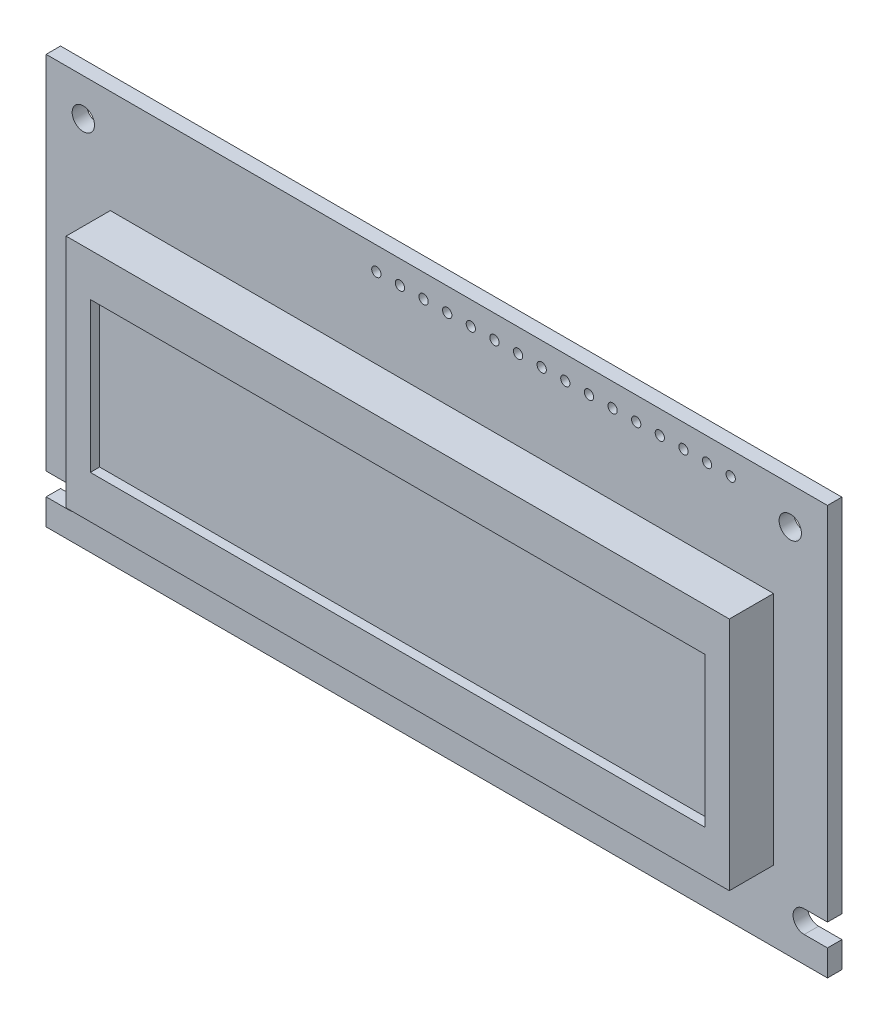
ISO-10303-21;
HEADER;
FILE_DESCRIPTION(('STEP AP214'),'2;1');
FILE_NAME('part.step','',(''),(''),'','','');
FILE_SCHEMA(('AUTOMOTIVE_DESIGN { 1 0 10303 214 1 1 1 1 }'));
ENDSEC;
DATA;
#1=APPLICATION_CONTEXT('core data for automotive mechanical design processes');
#2=APPLICATION_PROTOCOL_DEFINITION('international standard','automotive_design',2000,#1);
#3=PRODUCT_CONTEXT('',#1,'mechanical');
#4=PRODUCT('Part','Part','',(#3));
#5=PRODUCT_RELATED_PRODUCT_CATEGORY('part','',(#4));
#6=PRODUCT_DEFINITION_FORMATION('','',#4);
#7=PRODUCT_DEFINITION_CONTEXT('part definition',#1,'design');
#8=PRODUCT_DEFINITION('design','',#6,#7);
#9=PRODUCT_DEFINITION_SHAPE('','',#8);
#10=(LENGTH_UNIT() NAMED_UNIT(*) SI_UNIT(.MILLI.,.METRE.));
#11=(NAMED_UNIT(*) PLANE_ANGLE_UNIT() SI_UNIT($,.RADIAN.));
#12=(NAMED_UNIT(*) SI_UNIT($,.STERADIAN.) SOLID_ANGLE_UNIT());
#13=UNCERTAINTY_MEASURE_WITH_UNIT(LENGTH_MEASURE(1.E-05),#10,'distance_accuracy_value','');
#14=(GEOMETRIC_REPRESENTATION_CONTEXT(3) GLOBAL_UNCERTAINTY_ASSIGNED_CONTEXT((#13)) GLOBAL_UNIT_ASSIGNED_CONTEXT((#10,
#11,#12)) REPRESENTATION_CONTEXT('',''));
#15=CARTESIAN_POINT('',(0.,0.,0.));
#16=DIRECTION('',(0.,0.,1.));
#17=DIRECTION('',(1.,0.,0.));
#18=AXIS2_PLACEMENT_3D('',#15,#16,#17);
#19=CARTESIAN_POINT('',(-60.400836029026,-8.00950166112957,1.55));
#20=DIRECTION('',(0.,0.,1.));
#21=DIRECTION('',(1.,0.,0.));
#22=AXIS2_PLACEMENT_3D('',#19,#20,#21);
#23=PLANE('',#22);
#24=CARTESIAN_POINT('',(10.6991639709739,29.4904983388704,1.55));
#25=DIRECTION('',(0.,0.,1.));
#26=DIRECTION('',(1.,0.,0.));
#27=AXIS2_PLACEMENT_3D('',#24,#25,#26);
#28=CIRCLE('',#27,0.499999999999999);
#29=CARTESIAN_POINT('',(11.1991639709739,29.4904983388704,1.55));
#30=VERTEX_POINT('',#29);
#31=EDGE_CURVE('E245',#30,#30,#28,.T.);
#32=ORIENTED_EDGE('',*,*,#31,.F.);
#33=EDGE_LOOP('',(#32));
#34=FACE_BOUND('',#33,.T.);
#35=CARTESIAN_POINT('',(5.61916397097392,29.4904983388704,1.55));
#36=DIRECTION('',(0.,0.,1.));
#37=DIRECTION('',(1.,0.,0.));
#38=AXIS2_PLACEMENT_3D('',#35,#36,#37);
#39=CIRCLE('',#38,0.499999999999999);
#40=CARTESIAN_POINT('',(6.11916397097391,29.4904983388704,1.55));
#41=VERTEX_POINT('',#40);
#42=EDGE_CURVE('E257',#41,#41,#39,.T.);
#43=ORIENTED_EDGE('',*,*,#42,.F.);
#44=EDGE_LOOP('',(#43));
#45=FACE_BOUND('',#44,.T.);
#46=CARTESIAN_POINT('',(0.539163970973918,29.4904983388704,1.55));
#47=DIRECTION('',(0.,0.,1.));
#48=DIRECTION('',(1.,0.,0.));
#49=AXIS2_PLACEMENT_3D('',#46,#47,#48);
#50=CIRCLE('',#49,0.499999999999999);
#51=CARTESIAN_POINT('',(1.03916397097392,29.4904983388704,1.55));
#52=VERTEX_POINT('',#51);
#53=EDGE_CURVE('E269',#52,#52,#50,.T.);
#54=ORIENTED_EDGE('',*,*,#53,.F.);
#55=EDGE_LOOP('',(#54));
#56=FACE_BOUND('',#55,.T.);
#57=CARTESIAN_POINT('',(-4.54083602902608,29.4904983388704,1.55));
#58=DIRECTION('',(0.,0.,1.));
#59=DIRECTION('',(1.,0.,0.));
#60=AXIS2_PLACEMENT_3D('',#57,#58,#59);
#61=CIRCLE('',#60,0.499999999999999);
#62=CARTESIAN_POINT('',(-4.04083602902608,29.4904983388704,1.55));
#63=VERTEX_POINT('',#62);
#64=EDGE_CURVE('E281',#63,#63,#61,.T.);
#65=ORIENTED_EDGE('',*,*,#64,.F.);
#66=EDGE_LOOP('',(#65));
#67=FACE_BOUND('',#66,.T.);
#68=CARTESIAN_POINT('',(-9.62083602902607,29.4904983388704,1.55));
#69=DIRECTION('',(0.,0.,1.));
#70=DIRECTION('',(1.,0.,0.));
#71=AXIS2_PLACEMENT_3D('',#68,#69,#70);
#72=CIRCLE('',#71,0.499999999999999);
#73=CARTESIAN_POINT('',(-9.12083602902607,29.4904983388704,1.55));
#74=VERTEX_POINT('',#73);
#75=EDGE_CURVE('E293',#74,#74,#72,.T.);
#76=ORIENTED_EDGE('',*,*,#75,.F.);
#77=EDGE_LOOP('',(#76));
#78=FACE_BOUND('',#77,.T.);
#79=CARTESIAN_POINT('',(-14.7008360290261,29.4904983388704,1.55));
#80=DIRECTION('',(0.,0.,1.));
#81=DIRECTION('',(1.,0.,0.));
#82=AXIS2_PLACEMENT_3D('',#79,#80,#81);
#83=CIRCLE('',#82,0.499999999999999);
#84=CARTESIAN_POINT('',(-14.2008360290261,29.4904983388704,1.55));
#85=VERTEX_POINT('',#84);
#86=EDGE_CURVE('E305',#85,#85,#83,.T.);
#87=ORIENTED_EDGE('',*,*,#86,.F.);
#88=EDGE_LOOP('',(#87));
#89=FACE_BOUND('',#88,.T.);
#90=CARTESIAN_POINT('',(-19.7808360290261,29.4904983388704,1.55));
#91=DIRECTION('',(0.,0.,1.));
#92=DIRECTION('',(1.,0.,0.));
#93=AXIS2_PLACEMENT_3D('',#90,#91,#92);
#94=CIRCLE('',#93,0.499999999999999);
#95=CARTESIAN_POINT('',(-19.2808360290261,29.4904983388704,1.55));
#96=VERTEX_POINT('',#95);
#97=EDGE_CURVE('E317',#96,#96,#94,.T.);
#98=ORIENTED_EDGE('',*,*,#97,.F.);
#99=EDGE_LOOP('',(#98));
#100=FACE_BOUND('',#99,.T.);
#101=CARTESIAN_POINT('',(-24.8608360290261,29.4904983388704,1.55));
#102=DIRECTION('',(0.,0.,1.));
#103=DIRECTION('',(1.,0.,0.));
#104=AXIS2_PLACEMENT_3D('',#101,#102,#103);
#105=CIRCLE('',#104,0.499999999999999);
#106=CARTESIAN_POINT('',(-24.3608360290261,29.4904983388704,1.55));
#107=VERTEX_POINT('',#106);
#108=EDGE_CURVE('E329',#107,#107,#105,.T.);
#109=ORIENTED_EDGE('',*,*,#108,.F.);
#110=EDGE_LOOP('',(#109));
#111=FACE_BOUND('',#110,.T.);
#112=CARTESIAN_POINT('',(-58.900836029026,27.9904983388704,1.55));
#113=DIRECTION('',(0.,0.,1.));
#114=DIRECTION('',(1.,0.,0.));
#115=AXIS2_PLACEMENT_3D('',#112,#113,#114);
#116=CIRCLE('',#115,1.2);
#117=CARTESIAN_POINT('',(-60.100836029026,27.9904983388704,1.55));
#118=VERTEX_POINT('',#117);
#119=EDGE_CURVE('E341',#118,#118,#116,.T.);
#120=ORIENTED_EDGE('',*,*,#119,.F.);
#121=EDGE_LOOP('',(#120));
#122=FACE_BOUND('',#121,.T.);
#123=DIRECTION('',(0.,-1.,0.));
#124=VECTOR('',#123,1.);
#125=CARTESIAN_POINT('',(-62.900836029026,31.9904983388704,1.55));
#126=LINE('',#125,#124);
#127=CARTESIAN_POINT('',(-62.900836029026,31.9904983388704,1.55));
#128=VERTEX_POINT('',#127);
#129=CARTESIAN_POINT('',(-62.900836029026,-6.80950166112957,1.55));
#130=VERTEX_POINT('',#129);
#131=EDGE_CURVE('E347',#128,#130,#126,.T.);
#132=ORIENTED_EDGE('',*,*,#131,.T.);
#133=DIRECTION('',(1.,0.,0.));
#134=VECTOR('',#133,1.);
#135=CARTESIAN_POINT('',(-60.400836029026,-6.80950166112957,1.55));
#136=LINE('',#135,#134);
#137=CARTESIAN_POINT('',(-60.400836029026,-6.80950166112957,1.55));
#138=VERTEX_POINT('',#137);
#139=EDGE_CURVE('E350',#130,#138,#136,.T.);
#140=ORIENTED_EDGE('',*,*,#139,.T.);
#141=CARTESIAN_POINT('',(-60.400836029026,-8.00950166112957,1.55));
#142=DIRECTION('',(0.,0.,-1.));
#143=DIRECTION('',(1.,0.,0.));
#144=AXIS2_PLACEMENT_3D('',#141,#142,#143);
#145=CIRCLE('',#144,1.2);
#146=CARTESIAN_POINT('',(-60.400836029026,-9.20950166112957,1.55));
#147=VERTEX_POINT('',#146);
#148=EDGE_CURVE('E353',#138,#147,#145,.T.);
#149=ORIENTED_EDGE('',*,*,#148,.T.);
#150=DIRECTION('',(-1.,0.,0.));
#151=VECTOR('',#150,1.);
#152=CARTESIAN_POINT('',(-60.400836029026,-9.20950166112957,1.55));
#153=LINE('',#152,#151);
#154=CARTESIAN_POINT('',(-62.900836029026,-9.20950166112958,1.55));
#155=VERTEX_POINT('',#154);
#156=EDGE_CURVE('E355',#147,#155,#153,.T.);
#157=ORIENTED_EDGE('',*,*,#156,.T.);
#158=DIRECTION('',(0.,-1.,0.));
#159=VECTOR('',#158,1.);
#160=CARTESIAN_POINT('',(-62.900836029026,-9.20950166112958,1.55));
#161=LINE('',#160,#159);
#162=CARTESIAN_POINT('',(-62.900836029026,-12.0095016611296,1.55));
#163=VERTEX_POINT('',#162);
#164=EDGE_CURVE('E357',#155,#163,#161,.T.);
#165=ORIENTED_EDGE('',*,*,#164,.T.);
#166=DIRECTION('',(1.,0.,0.));
#167=VECTOR('',#166,1.);
#168=CARTESIAN_POINT('',(-62.900836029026,-12.0095016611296,1.55));
#169=LINE('',#168,#167);
#170=CARTESIAN_POINT('',(21.099163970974,-12.0095016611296,1.55));
#171=VERTEX_POINT('',#170);
#172=EDGE_CURVE('E359',#163,#171,#169,.T.);
#173=ORIENTED_EDGE('',*,*,#172,.T.);
#174=DIRECTION('',(0.,1.,0.));
#175=VECTOR('',#174,1.);
#176=CARTESIAN_POINT('',(21.0991639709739,-9.20950166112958,1.55));
#177=LINE('',#176,#175);
#178=CARTESIAN_POINT('',(21.0991639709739,-9.20950166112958,1.55));
#179=VERTEX_POINT('',#178);
#180=EDGE_CURVE('E361',#171,#179,#177,.T.);
#181=ORIENTED_EDGE('',*,*,#180,.T.);
#182=DIRECTION('',(-1.,0.,0.));
#183=VECTOR('',#182,1.);
#184=CARTESIAN_POINT('',(18.5991639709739,-9.20950166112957,1.55));
#185=LINE('',#184,#183);
#186=CARTESIAN_POINT('',(18.5991639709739,-9.20950166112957,1.55));
#187=VERTEX_POINT('',#186);
#188=EDGE_CURVE('E363',#179,#187,#185,.T.);
#189=ORIENTED_EDGE('',*,*,#188,.T.);
#190=CARTESIAN_POINT('',(18.5991639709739,-8.00950166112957,1.55));
#191=DIRECTION('',(0.,0.,-1.));
#192=DIRECTION('',(-1.,0.,0.));
#193=AXIS2_PLACEMENT_3D('',#190,#191,#192);
#194=CIRCLE('',#193,1.2);
#195=CARTESIAN_POINT('',(18.5991639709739,-6.80950166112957,1.55));
#196=VERTEX_POINT('',#195);
#197=EDGE_CURVE('E365',#187,#196,#194,.T.);
#198=ORIENTED_EDGE('',*,*,#197,.T.);
#199=DIRECTION('',(1.,0.,0.));
#200=VECTOR('',#199,1.);
#201=CARTESIAN_POINT('',(18.5991639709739,-6.80950166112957,1.55));
#202=LINE('',#201,#200);
#203=CARTESIAN_POINT('',(21.0991639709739,-6.80950166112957,1.55));
#204=VERTEX_POINT('',#203);
#205=EDGE_CURVE('E367',#196,#204,#202,.T.);
#206=ORIENTED_EDGE('',*,*,#205,.T.);
#207=DIRECTION('',(0.,1.,0.));
#208=VECTOR('',#207,1.);
#209=CARTESIAN_POINT('',(21.099163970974,31.9904983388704,1.55));
#210=LINE('',#209,#208);
#211=CARTESIAN_POINT('',(21.099163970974,31.9904983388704,1.55));
#212=VERTEX_POINT('',#211);
#213=EDGE_CURVE('E369',#204,#212,#210,.T.);
#214=ORIENTED_EDGE('',*,*,#213,.T.);
#215=DIRECTION('',(-1.,0.,0.));
#216=VECTOR('',#215,1.);
#217=CARTESIAN_POINT('',(-62.900836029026,31.9904983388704,1.55));
#218=LINE('',#217,#216);
#219=EDGE_CURVE('E371',#212,#128,#218,.T.);
#220=ORIENTED_EDGE('',*,*,#219,.T.);
#221=EDGE_LOOP('',(#132,#140,#149,#157,#165,#173,#181,#189,#198,#206,#214,#220));
#222=FACE_BOUND('',#221,.T.);
#223=CARTESIAN_POINT('',(-27.400836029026,29.4904983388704,1.55));
#224=DIRECTION('',(0.,0.,1.));
#225=DIRECTION('',(1.,0.,0.));
#226=AXIS2_PLACEMENT_3D('',#223,#224,#225);
#227=CIRCLE('',#226,0.499999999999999);
#228=CARTESIAN_POINT('',(-26.900836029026,29.4904983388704,1.55));
#229=VERTEX_POINT('',#228);
#230=EDGE_CURVE('E335',#229,#229,#227,.T.);
#231=ORIENTED_EDGE('',*,*,#230,.F.);
#232=EDGE_LOOP('',(#231));
#233=FACE_BOUND('',#232,.T.);
#234=CARTESIAN_POINT('',(-22.3208360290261,29.4904983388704,1.55));
#235=DIRECTION('',(0.,0.,1.));
#236=DIRECTION('',(1.,0.,0.));
#237=AXIS2_PLACEMENT_3D('',#234,#235,#236);
#238=CIRCLE('',#237,0.499999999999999);
#239=CARTESIAN_POINT('',(-21.8208360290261,29.4904983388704,1.55));
#240=VERTEX_POINT('',#239);
#241=EDGE_CURVE('E323',#240,#240,#238,.T.);
#242=ORIENTED_EDGE('',*,*,#241,.F.);
#243=EDGE_LOOP('',(#242));
#244=FACE_BOUND('',#243,.T.);
#245=CARTESIAN_POINT('',(-17.2408360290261,29.4904983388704,1.55));
#246=DIRECTION('',(0.,0.,1.));
#247=DIRECTION('',(1.,0.,0.));
#248=AXIS2_PLACEMENT_3D('',#245,#246,#247);
#249=CIRCLE('',#248,0.499999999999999);
#250=CARTESIAN_POINT('',(-16.7408360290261,29.4904983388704,1.55));
#251=VERTEX_POINT('',#250);
#252=EDGE_CURVE('E311',#251,#251,#249,.T.);
#253=ORIENTED_EDGE('',*,*,#252,.F.);
#254=EDGE_LOOP('',(#253));
#255=FACE_BOUND('',#254,.T.);
#256=CARTESIAN_POINT('',(-12.1608360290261,29.4904983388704,1.55));
#257=DIRECTION('',(0.,0.,1.));
#258=DIRECTION('',(1.,0.,0.));
#259=AXIS2_PLACEMENT_3D('',#256,#257,#258);
#260=CIRCLE('',#259,0.499999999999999);
#261=CARTESIAN_POINT('',(-11.6608360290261,29.4904983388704,1.55));
#262=VERTEX_POINT('',#261);
#263=EDGE_CURVE('E299',#262,#262,#260,.T.);
#264=ORIENTED_EDGE('',*,*,#263,.F.);
#265=EDGE_LOOP('',(#264));
#266=FACE_BOUND('',#265,.T.);
#267=CARTESIAN_POINT('',(-7.08083602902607,29.4904983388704,1.55));
#268=DIRECTION('',(0.,0.,1.));
#269=DIRECTION('',(1.,0.,0.));
#270=AXIS2_PLACEMENT_3D('',#267,#268,#269);
#271=CIRCLE('',#270,0.499999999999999);
#272=CARTESIAN_POINT('',(-6.58083602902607,29.4904983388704,1.55));
#273=VERTEX_POINT('',#272);
#274=EDGE_CURVE('E287',#273,#273,#271,.T.);
#275=ORIENTED_EDGE('',*,*,#274,.F.);
#276=EDGE_LOOP('',(#275));
#277=FACE_BOUND('',#276,.T.);
#278=CARTESIAN_POINT('',(-2.00083602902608,29.4904983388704,1.55));
#279=DIRECTION('',(0.,0.,1.));
#280=DIRECTION('',(1.,0.,0.));
#281=AXIS2_PLACEMENT_3D('',#278,#279,#280);
#282=CIRCLE('',#281,0.499999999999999);
#283=CARTESIAN_POINT('',(-1.50083602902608,29.4904983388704,1.55));
#284=VERTEX_POINT('',#283);
#285=EDGE_CURVE('E275',#284,#284,#282,.T.);
#286=ORIENTED_EDGE('',*,*,#285,.F.);
#287=EDGE_LOOP('',(#286));
#288=FACE_BOUND('',#287,.T.);
#289=CARTESIAN_POINT('',(3.07916397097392,29.4904983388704,1.55));
#290=DIRECTION('',(0.,0.,1.));
#291=DIRECTION('',(1.,0.,0.));
#292=AXIS2_PLACEMENT_3D('',#289,#290,#291);
#293=CIRCLE('',#292,0.499999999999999);
#294=CARTESIAN_POINT('',(3.57916397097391,29.4904983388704,1.55));
#295=VERTEX_POINT('',#294);
#296=EDGE_CURVE('E263',#295,#295,#293,.T.);
#297=ORIENTED_EDGE('',*,*,#296,.F.);
#298=EDGE_LOOP('',(#297));
#299=FACE_BOUND('',#298,.T.);
#300=CARTESIAN_POINT('',(8.15916397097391,29.4904983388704,1.55));
#301=DIRECTION('',(0.,0.,1.));
#302=DIRECTION('',(1.,0.,0.));
#303=AXIS2_PLACEMENT_3D('',#300,#301,#302);
#304=CIRCLE('',#303,0.499999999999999);
#305=CARTESIAN_POINT('',(8.65916397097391,29.4904983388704,1.55));
#306=VERTEX_POINT('',#305);
#307=EDGE_CURVE('E251',#306,#306,#304,.T.);
#308=ORIENTED_EDGE('',*,*,#307,.F.);
#309=EDGE_LOOP('',(#308));
#310=FACE_BOUND('',#309,.T.);
#311=CARTESIAN_POINT('',(17.0991639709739,27.9904983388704,1.55));
#312=DIRECTION('',(0.,0.,1.));
#313=DIRECTION('',(-1.,0.,0.));
#314=AXIS2_PLACEMENT_3D('',#311,#312,#313);
#315=CIRCLE('',#314,1.2);
#316=CARTESIAN_POINT('',(15.8991639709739,27.9904983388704,1.55));
#317=VERTEX_POINT('',#316);
#318=EDGE_CURVE('E239',#317,#317,#315,.T.);
#319=ORIENTED_EDGE('',*,*,#318,.F.);
#320=EDGE_LOOP('',(#319));
#321=FACE_BOUND('',#320,.T.);
#322=DIRECTION('',(1.,0.,0.));
#323=VECTOR('',#322,1.);
#324=CARTESIAN_POINT('',(-56.0008360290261,-4.40950166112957,1.55));
#325=LINE('',#324,#323);
#326=CARTESIAN_POINT('',(-56.0008360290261,-4.40950166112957,1.55));
#327=VERTEX_POINT('',#326);
#328=CARTESIAN_POINT('',(15.299163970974,-4.40950166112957,1.55));
#329=VERTEX_POINT('',#328);
#330=EDGE_CURVE('E225',#327,#329,#325,.T.);
#331=ORIENTED_EDGE('',*,*,#330,.F.);
#332=DIRECTION('',(0.,-1.,0.));
#333=VECTOR('',#332,1.);
#334=CARTESIAN_POINT('',(-56.000836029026,20.8904983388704,1.55));
#335=LINE('',#334,#333);
#336=CARTESIAN_POINT('',(-56.000836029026,20.8904983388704,1.55));
#337=VERTEX_POINT('',#336);
#338=EDGE_CURVE('E208',#337,#327,#335,.T.);
#339=ORIENTED_EDGE('',*,*,#338,.F.);
#340=DIRECTION('',(-1.,0.,0.));
#341=VECTOR('',#340,1.);
#342=CARTESIAN_POINT('',(-56.000836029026,20.8904983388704,1.55));
#343=LINE('',#342,#341);
#344=CARTESIAN_POINT('',(15.299163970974,20.8904983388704,1.55));
#345=VERTEX_POINT('',#344);
#346=EDGE_CURVE('E216',#345,#337,#343,.T.);
#347=ORIENTED_EDGE('',*,*,#346,.F.);
#348=DIRECTION('',(0.,1.,0.));
#349=VECTOR('',#348,1.);
#350=CARTESIAN_POINT('',(15.299163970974,20.8904983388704,1.55));
#351=LINE('',#350,#349);
#352=EDGE_CURVE('E227',#329,#345,#351,.T.);
#353=ORIENTED_EDGE('',*,*,#352,.F.);
#354=EDGE_LOOP('',(#331,#339,#347,#353));
#355=FACE_BOUND('',#354,.T.);
#356=ADVANCED_FACE('F35',(#34,#45,#56,#67,#78,#89,#100,#111,#122,#222,#233,#244,#255,#266,#277,
#288,#299,#310,#321,#355),#23,.T.);
#357=CARTESIAN_POINT('',(-60.400836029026,-8.00950166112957,0.));
#358=DIRECTION('',(0.,0.,1.));
#359=DIRECTION('',(1.,0.,0.));
#360=AXIS2_PLACEMENT_3D('',#357,#358,#359);
#361=PLANE('',#360);
#362=DIRECTION('',(0.,-1.,0.));
#363=VECTOR('',#362,1.);
#364=CARTESIAN_POINT('',(-62.900836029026,31.9904983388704,0.));
#365=LINE('',#364,#363);
#366=CARTESIAN_POINT('',(-62.900836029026,31.9904983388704,0.));
#367=VERTEX_POINT('',#366);
#368=CARTESIAN_POINT('',(-62.900836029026,-6.80950166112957,0.));
#369=VERTEX_POINT('',#368);
#370=EDGE_CURVE('E344',#367,#369,#365,.T.);
#371=ORIENTED_EDGE('',*,*,#370,.F.);
#372=DIRECTION('',(-1.,0.,0.));
#373=VECTOR('',#372,1.);
#374=CARTESIAN_POINT('',(-62.900836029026,31.9904983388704,0.));
#375=LINE('',#374,#373);
#376=CARTESIAN_POINT('',(21.099163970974,31.9904983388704,0.));
#377=VERTEX_POINT('',#376);
#378=EDGE_CURVE('E351',#377,#367,#375,.T.);
#379=ORIENTED_EDGE('',*,*,#378,.F.);
#380=DIRECTION('',(0.,1.,0.));
#381=VECTOR('',#380,1.);
#382=CARTESIAN_POINT('',(21.099163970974,31.9904983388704,0.));
#383=LINE('',#382,#381);
#384=CARTESIAN_POINT('',(21.0991639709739,-6.80950166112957,0.));
#385=VERTEX_POINT('',#384);
#386=EDGE_CURVE('E394',#385,#377,#383,.T.);
#387=ORIENTED_EDGE('',*,*,#386,.F.);
#388=DIRECTION('',(1.,0.,0.));
#389=VECTOR('',#388,1.);
#390=CARTESIAN_POINT('',(18.5991639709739,-6.80950166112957,0.));
#391=LINE('',#390,#389);
#392=CARTESIAN_POINT('',(18.5991639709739,-6.80950166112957,0.));
#393=VERTEX_POINT('',#392);
#394=EDGE_CURVE('E392',#393,#385,#391,.T.);
#395=ORIENTED_EDGE('',*,*,#394,.F.);
#396=CARTESIAN_POINT('',(18.5991639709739,-8.00950166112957,0.));
#397=DIRECTION('',(0.,0.,-1.));
#398=DIRECTION('',(-1.,0.,0.));
#399=AXIS2_PLACEMENT_3D('',#396,#397,#398);
#400=CIRCLE('',#399,1.2);
#401=CARTESIAN_POINT('',(18.5991639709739,-9.20950166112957,0.));
#402=VERTEX_POINT('',#401);
#403=EDGE_CURVE('E390',#402,#393,#400,.T.);
#404=ORIENTED_EDGE('',*,*,#403,.F.);
#405=DIRECTION('',(-1.,0.,0.));
#406=VECTOR('',#405,1.);
#407=CARTESIAN_POINT('',(18.5991639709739,-9.20950166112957,0.));
#408=LINE('',#407,#406);
#409=CARTESIAN_POINT('',(21.0991639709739,-9.20950166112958,0.));
#410=VERTEX_POINT('',#409);
#411=EDGE_CURVE('E388',#410,#402,#408,.T.);
#412=ORIENTED_EDGE('',*,*,#411,.F.);
#413=DIRECTION('',(0.,1.,0.));
#414=VECTOR('',#413,1.);
#415=CARTESIAN_POINT('',(21.0991639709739,-9.20950166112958,0.));
#416=LINE('',#415,#414);
#417=CARTESIAN_POINT('',(21.099163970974,-12.0095016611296,0.));
#418=VERTEX_POINT('',#417);
#419=EDGE_CURVE('E386',#418,#410,#416,.T.);
#420=ORIENTED_EDGE('',*,*,#419,.F.);
#421=DIRECTION('',(1.,0.,0.));
#422=VECTOR('',#421,1.);
#423=CARTESIAN_POINT('',(-62.900836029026,-12.0095016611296,0.));
#424=LINE('',#423,#422);
#425=CARTESIAN_POINT('',(-62.900836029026,-12.0095016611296,0.));
#426=VERTEX_POINT('',#425);
#427=EDGE_CURVE('E384',#426,#418,#424,.T.);
#428=ORIENTED_EDGE('',*,*,#427,.F.);
#429=DIRECTION('',(0.,-1.,0.));
#430=VECTOR('',#429,1.);
#431=CARTESIAN_POINT('',(-62.900836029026,-9.20950166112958,0.));
#432=LINE('',#431,#430);
#433=CARTESIAN_POINT('',(-62.900836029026,-9.20950166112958,0.));
#434=VERTEX_POINT('',#433);
#435=EDGE_CURVE('E382',#434,#426,#432,.T.);
#436=ORIENTED_EDGE('',*,*,#435,.F.);
#437=DIRECTION('',(-1.,0.,0.));
#438=VECTOR('',#437,1.);
#439=CARTESIAN_POINT('',(-60.400836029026,-9.20950166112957,0.));
#440=LINE('',#439,#438);
#441=CARTESIAN_POINT('',(-60.400836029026,-9.20950166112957,0.));
#442=VERTEX_POINT('',#441);
#443=EDGE_CURVE('E380',#442,#434,#440,.T.);
#444=ORIENTED_EDGE('',*,*,#443,.F.);
#445=CARTESIAN_POINT('',(-60.400836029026,-8.00950166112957,0.));
#446=DIRECTION('',(0.,0.,-1.));
#447=DIRECTION('',(1.,0.,0.));
#448=AXIS2_PLACEMENT_3D('',#445,#446,#447);
#449=CIRCLE('',#448,1.2);
#450=CARTESIAN_POINT('',(-60.400836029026,-6.80950166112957,0.));
#451=VERTEX_POINT('',#450);
#452=EDGE_CURVE('E378',#451,#442,#449,.T.);
#453=ORIENTED_EDGE('',*,*,#452,.F.);
#454=DIRECTION('',(1.,0.,0.));
#455=VECTOR('',#454,1.);
#456=CARTESIAN_POINT('',(-60.400836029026,-6.80950166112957,0.));
#457=LINE('',#456,#455);
#458=EDGE_CURVE('E376',#369,#451,#457,.T.);
#459=ORIENTED_EDGE('',*,*,#458,.F.);
#460=EDGE_LOOP('',(#371,#379,#387,#395,#404,#412,#420,#428,#436,#444,#453,#459));
#461=FACE_BOUND('',#460,.T.);
#462=CARTESIAN_POINT('',(-58.900836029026,27.9904983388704,0.));
#463=DIRECTION('',(0.,0.,1.));
#464=DIRECTION('',(1.,0.,0.));
#465=AXIS2_PLACEMENT_3D('',#462,#463,#464);
#466=CIRCLE('',#465,1.2);
#467=CARTESIAN_POINT('',(-60.100836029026,27.9904983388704,0.));
#468=VERTEX_POINT('',#467);
#469=EDGE_CURVE('E338',#468,#468,#466,.T.);
#470=ORIENTED_EDGE('',*,*,#469,.T.);
#471=EDGE_LOOP('',(#470));
#472=FACE_BOUND('',#471,.T.);
#473=CARTESIAN_POINT('',(-27.400836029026,29.4904983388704,0.));
#474=DIRECTION('',(0.,0.,1.));
#475=DIRECTION('',(1.,0.,0.));
#476=AXIS2_PLACEMENT_3D('',#473,#474,#475);
#477=CIRCLE('',#476,0.499999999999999);
#478=CARTESIAN_POINT('',(-26.900836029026,29.4904983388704,0.));
#479=VERTEX_POINT('',#478);
#480=EDGE_CURVE('E332',#479,#479,#477,.T.);
#481=ORIENTED_EDGE('',*,*,#480,.T.);
#482=EDGE_LOOP('',(#481));
#483=FACE_BOUND('',#482,.T.);
#484=CARTESIAN_POINT('',(-24.8608360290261,29.4904983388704,0.));
#485=DIRECTION('',(0.,0.,1.));
#486=DIRECTION('',(1.,0.,0.));
#487=AXIS2_PLACEMENT_3D('',#484,#485,#486);
#488=CIRCLE('',#487,0.499999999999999);
#489=CARTESIAN_POINT('',(-24.3608360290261,29.4904983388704,0.));
#490=VERTEX_POINT('',#489);
#491=EDGE_CURVE('E326',#490,#490,#488,.T.);
#492=ORIENTED_EDGE('',*,*,#491,.T.);
#493=EDGE_LOOP('',(#492));
#494=FACE_BOUND('',#493,.T.);
#495=CARTESIAN_POINT('',(-22.3208360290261,29.4904983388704,0.));
#496=DIRECTION('',(0.,0.,1.));
#497=DIRECTION('',(1.,0.,0.));
#498=AXIS2_PLACEMENT_3D('',#495,#496,#497);
#499=CIRCLE('',#498,0.499999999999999);
#500=CARTESIAN_POINT('',(-21.8208360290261,29.4904983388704,0.));
#501=VERTEX_POINT('',#500);
#502=EDGE_CURVE('E320',#501,#501,#499,.T.);
#503=ORIENTED_EDGE('',*,*,#502,.T.);
#504=EDGE_LOOP('',(#503));
#505=FACE_BOUND('',#504,.T.);
#506=CARTESIAN_POINT('',(-19.7808360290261,29.4904983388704,0.));
#507=DIRECTION('',(0.,0.,1.));
#508=DIRECTION('',(1.,0.,0.));
#509=AXIS2_PLACEMENT_3D('',#506,#507,#508);
#510=CIRCLE('',#509,0.499999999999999);
#511=CARTESIAN_POINT('',(-19.2808360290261,29.4904983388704,0.));
#512=VERTEX_POINT('',#511);
#513=EDGE_CURVE('E314',#512,#512,#510,.T.);
#514=ORIENTED_EDGE('',*,*,#513,.T.);
#515=EDGE_LOOP('',(#514));
#516=FACE_BOUND('',#515,.T.);
#517=CARTESIAN_POINT('',(-17.2408360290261,29.4904983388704,0.));
#518=DIRECTION('',(0.,0.,1.));
#519=DIRECTION('',(1.,0.,0.));
#520=AXIS2_PLACEMENT_3D('',#517,#518,#519);
#521=CIRCLE('',#520,0.499999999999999);
#522=CARTESIAN_POINT('',(-16.7408360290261,29.4904983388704,0.));
#523=VERTEX_POINT('',#522);
#524=EDGE_CURVE('E308',#523,#523,#521,.T.);
#525=ORIENTED_EDGE('',*,*,#524,.T.);
#526=EDGE_LOOP('',(#525));
#527=FACE_BOUND('',#526,.T.);
#528=CARTESIAN_POINT('',(-14.7008360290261,29.4904983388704,0.));
#529=DIRECTION('',(0.,0.,1.));
#530=DIRECTION('',(1.,0.,0.));
#531=AXIS2_PLACEMENT_3D('',#528,#529,#530);
#532=CIRCLE('',#531,0.499999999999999);
#533=CARTESIAN_POINT('',(-14.2008360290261,29.4904983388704,0.));
#534=VERTEX_POINT('',#533);
#535=EDGE_CURVE('E302',#534,#534,#532,.T.);
#536=ORIENTED_EDGE('',*,*,#535,.T.);
#537=EDGE_LOOP('',(#536));
#538=FACE_BOUND('',#537,.T.);
#539=CARTESIAN_POINT('',(-12.1608360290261,29.4904983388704,0.));
#540=DIRECTION('',(0.,0.,1.));
#541=DIRECTION('',(1.,0.,0.));
#542=AXIS2_PLACEMENT_3D('',#539,#540,#541);
#543=CIRCLE('',#542,0.499999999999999);
#544=CARTESIAN_POINT('',(-11.6608360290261,29.4904983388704,0.));
#545=VERTEX_POINT('',#544);
#546=EDGE_CURVE('E296',#545,#545,#543,.T.);
#547=ORIENTED_EDGE('',*,*,#546,.T.);
#548=EDGE_LOOP('',(#547));
#549=FACE_BOUND('',#548,.T.);
#550=CARTESIAN_POINT('',(-9.62083602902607,29.4904983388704,0.));
#551=DIRECTION('',(0.,0.,1.));
#552=DIRECTION('',(1.,0.,0.));
#553=AXIS2_PLACEMENT_3D('',#550,#551,#552);
#554=CIRCLE('',#553,0.499999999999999);
#555=CARTESIAN_POINT('',(-9.12083602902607,29.4904983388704,0.));
#556=VERTEX_POINT('',#555);
#557=EDGE_CURVE('E290',#556,#556,#554,.T.);
#558=ORIENTED_EDGE('',*,*,#557,.T.);
#559=EDGE_LOOP('',(#558));
#560=FACE_BOUND('',#559,.T.);
#561=CARTESIAN_POINT('',(-7.08083602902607,29.4904983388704,0.));
#562=DIRECTION('',(0.,0.,1.));
#563=DIRECTION('',(1.,0.,0.));
#564=AXIS2_PLACEMENT_3D('',#561,#562,#563);
#565=CIRCLE('',#564,0.499999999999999);
#566=CARTESIAN_POINT('',(-6.58083602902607,29.4904983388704,0.));
#567=VERTEX_POINT('',#566);
#568=EDGE_CURVE('E284',#567,#567,#565,.T.);
#569=ORIENTED_EDGE('',*,*,#568,.T.);
#570=EDGE_LOOP('',(#569));
#571=FACE_BOUND('',#570,.T.);
#572=CARTESIAN_POINT('',(-4.54083602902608,29.4904983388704,0.));
#573=DIRECTION('',(0.,0.,1.));
#574=DIRECTION('',(1.,0.,0.));
#575=AXIS2_PLACEMENT_3D('',#572,#573,#574);
#576=CIRCLE('',#575,0.499999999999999);
#577=CARTESIAN_POINT('',(-4.04083602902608,29.4904983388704,0.));
#578=VERTEX_POINT('',#577);
#579=EDGE_CURVE('E278',#578,#578,#576,.T.);
#580=ORIENTED_EDGE('',*,*,#579,.T.);
#581=EDGE_LOOP('',(#580));
#582=FACE_BOUND('',#581,.T.);
#583=CARTESIAN_POINT('',(-2.00083602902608,29.4904983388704,0.));
#584=DIRECTION('',(0.,0.,1.));
#585=DIRECTION('',(1.,0.,0.));
#586=AXIS2_PLACEMENT_3D('',#583,#584,#585);
#587=CIRCLE('',#586,0.499999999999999);
#588=CARTESIAN_POINT('',(-1.50083602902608,29.4904983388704,0.));
#589=VERTEX_POINT('',#588);
#590=EDGE_CURVE('E272',#589,#589,#587,.T.);
#591=ORIENTED_EDGE('',*,*,#590,.T.);
#592=EDGE_LOOP('',(#591));
#593=FACE_BOUND('',#592,.T.);
#594=CARTESIAN_POINT('',(0.539163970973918,29.4904983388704,0.));
#595=DIRECTION('',(0.,0.,1.));
#596=DIRECTION('',(1.,0.,0.));
#597=AXIS2_PLACEMENT_3D('',#594,#595,#596);
#598=CIRCLE('',#597,0.499999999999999);
#599=CARTESIAN_POINT('',(1.03916397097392,29.4904983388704,0.));
#600=VERTEX_POINT('',#599);
#601=EDGE_CURVE('E266',#600,#600,#598,.T.);
#602=ORIENTED_EDGE('',*,*,#601,.T.);
#603=EDGE_LOOP('',(#602));
#604=FACE_BOUND('',#603,.T.);
#605=CARTESIAN_POINT('',(3.07916397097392,29.4904983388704,0.));
#606=DIRECTION('',(0.,0.,1.));
#607=DIRECTION('',(1.,0.,0.));
#608=AXIS2_PLACEMENT_3D('',#605,#606,#607);
#609=CIRCLE('',#608,0.499999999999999);
#610=CARTESIAN_POINT('',(3.57916397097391,29.4904983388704,0.));
#611=VERTEX_POINT('',#610);
#612=EDGE_CURVE('E260',#611,#611,#609,.T.);
#613=ORIENTED_EDGE('',*,*,#612,.T.);
#614=EDGE_LOOP('',(#613));
#615=FACE_BOUND('',#614,.T.);
#616=CARTESIAN_POINT('',(5.61916397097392,29.4904983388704,0.));
#617=DIRECTION('',(0.,0.,1.));
#618=DIRECTION('',(1.,0.,0.));
#619=AXIS2_PLACEMENT_3D('',#616,#617,#618);
#620=CIRCLE('',#619,0.499999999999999);
#621=CARTESIAN_POINT('',(6.11916397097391,29.4904983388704,0.));
#622=VERTEX_POINT('',#621);
#623=EDGE_CURVE('E254',#622,#622,#620,.T.);
#624=ORIENTED_EDGE('',*,*,#623,.T.);
#625=EDGE_LOOP('',(#624));
#626=FACE_BOUND('',#625,.T.);
#627=CARTESIAN_POINT('',(8.15916397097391,29.4904983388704,0.));
#628=DIRECTION('',(0.,0.,1.));
#629=DIRECTION('',(1.,0.,0.));
#630=AXIS2_PLACEMENT_3D('',#627,#628,#629);
#631=CIRCLE('',#630,0.499999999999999);
#632=CARTESIAN_POINT('',(8.65916397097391,29.4904983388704,0.));
#633=VERTEX_POINT('',#632);
#634=EDGE_CURVE('E248',#633,#633,#631,.T.);
#635=ORIENTED_EDGE('',*,*,#634,.T.);
#636=EDGE_LOOP('',(#635));
#637=FACE_BOUND('',#636,.T.);
#638=CARTESIAN_POINT('',(10.6991639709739,29.4904983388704,0.));
#639=DIRECTION('',(0.,0.,1.));
#640=DIRECTION('',(1.,0.,0.));
#641=AXIS2_PLACEMENT_3D('',#638,#639,#640);
#642=CIRCLE('',#641,0.499999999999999);
#643=CARTESIAN_POINT('',(11.1991639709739,29.4904983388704,0.));
#644=VERTEX_POINT('',#643);
#645=EDGE_CURVE('E242',#644,#644,#642,.T.);
#646=ORIENTED_EDGE('',*,*,#645,.T.);
#647=EDGE_LOOP('',(#646));
#648=FACE_BOUND('',#647,.T.);
#649=CARTESIAN_POINT('',(17.0991639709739,27.9904983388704,0.));
#650=DIRECTION('',(0.,0.,1.));
#651=DIRECTION('',(-1.,0.,0.));
#652=AXIS2_PLACEMENT_3D('',#649,#650,#651);
#653=CIRCLE('',#652,1.2);
#654=CARTESIAN_POINT('',(15.8991639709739,27.9904983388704,0.));
#655=VERTEX_POINT('',#654);
#656=EDGE_CURVE('E238',#655,#655,#653,.T.);
#657=ORIENTED_EDGE('',*,*,#656,.T.);
#658=EDGE_LOOP('',(#657));
#659=FACE_BOUND('',#658,.T.);
#660=ADVANCED_FACE('F436',(#461,#472,#483,#494,#505,#516,#527,#538,#549,#560,#571,#582,#593,
#604,#615,#626,#637,#648,#659),#361,.F.);
#661=CARTESIAN_POINT('',(-62.900836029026,31.9904983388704,1.55));
#662=DIRECTION('',(1.,0.,0.));
#663=DIRECTION('',(0.,0.,-1.));
#664=AXIS2_PLACEMENT_3D('',#661,#662,#663);
#665=PLANE('',#664);
#666=ORIENTED_EDGE('',*,*,#370,.T.);
#667=DIRECTION('',(0.,0.,-1.));
#668=VECTOR('',#667,1.);
#669=CARTESIAN_POINT('',(-62.900836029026,-6.80950166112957,1.55));
#670=LINE('',#669,#668);
#671=EDGE_CURVE('E11',#130,#369,#670,.T.);
#672=ORIENTED_EDGE('',*,*,#671,.F.);
#673=ORIENTED_EDGE('',*,*,#131,.F.);
#674=DIRECTION('',(0.,0.,-1.));
#675=VECTOR('',#674,1.);
#676=CARTESIAN_POINT('',(-62.900836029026,31.9904983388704,1.55));
#677=LINE('',#676,#675);
#678=EDGE_CURVE('E373',#128,#367,#677,.T.);
#679=ORIENTED_EDGE('',*,*,#678,.T.);
#680=EDGE_LOOP('',(#666,#672,#673,#679));
#681=FACE_BOUND('',#680,.T.);
#682=ADVANCED_FACE('F37',(#681),#665,.F.);
#683=CARTESIAN_POINT('',(-60.400836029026,-6.80950166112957,1.55));
#684=DIRECTION('',(0.,1.,0.));
#685=DIRECTION('',(-1.,0.,0.));
#686=AXIS2_PLACEMENT_3D('',#683,#684,#685);
#687=PLANE('',#686);
#688=ORIENTED_EDGE('',*,*,#458,.T.);
#689=DIRECTION('',(0.,0.,-1.));
#690=VECTOR('',#689,1.);
#691=CARTESIAN_POINT('',(-60.400836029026,-6.80950166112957,1.55));
#692=LINE('',#691,#690);
#693=EDGE_CURVE('E43',#138,#451,#692,.T.);
#694=ORIENTED_EDGE('',*,*,#693,.F.);
#695=ORIENTED_EDGE('',*,*,#139,.F.);
#696=ORIENTED_EDGE('',*,*,#671,.T.);
#697=EDGE_LOOP('',(#688,#694,#695,#696));
#698=FACE_BOUND('',#697,.T.);
#699=ADVANCED_FACE('F454',(#698),#687,.F.);
#700=CARTESIAN_POINT('',(-60.400836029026,-8.00950166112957,1.55));
#701=DIRECTION('',(0.,0.,-1.));
#702=DIRECTION('',(-1.,0.,0.));
#703=AXIS2_PLACEMENT_3D('',#700,#701,#702);
#704=CYLINDRICAL_SURFACE('',#703,1.2);
#705=ORIENTED_EDGE('',*,*,#452,.T.);
#706=DIRECTION('',(0.,0.,-1.));
#707=VECTOR('',#706,1.);
#708=CARTESIAN_POINT('',(-60.400836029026,-9.20950166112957,1.55));
#709=LINE('',#708,#707);
#710=EDGE_CURVE('E423',#147,#442,#709,.T.);
#711=ORIENTED_EDGE('',*,*,#710,.F.);
#712=ORIENTED_EDGE('',*,*,#148,.F.);
#713=ORIENTED_EDGE('',*,*,#693,.T.);
#714=EDGE_LOOP('',(#705,#711,#712,#713));
#715=FACE_BOUND('',#714,.T.);
#716=ADVANCED_FACE('F430',(#715),#704,.F.);
#717=CARTESIAN_POINT('',(-60.400836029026,-9.20950166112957,1.55));
#718=DIRECTION('',(0.,-1.,0.));
#719=DIRECTION('',(1.,0.,0.));
#720=AXIS2_PLACEMENT_3D('',#717,#718,#719);
#721=PLANE('',#720);
#722=ORIENTED_EDGE('',*,*,#443,.T.);
#723=DIRECTION('',(0.,0.,-1.));
#724=VECTOR('',#723,1.);
#725=CARTESIAN_POINT('',(-62.900836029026,-9.20950166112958,1.55));
#726=LINE('',#725,#724);
#727=EDGE_CURVE('E420',#155,#434,#726,.T.);
#728=ORIENTED_EDGE('',*,*,#727,.F.);
#729=ORIENTED_EDGE('',*,*,#156,.F.);
#730=ORIENTED_EDGE('',*,*,#710,.T.);
#731=EDGE_LOOP('',(#722,#728,#729,#730));
#732=FACE_BOUND('',#731,.T.);
#733=ADVANCED_FACE('F442',(#732),#721,.F.);
#734=CARTESIAN_POINT('',(-62.900836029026,-9.20950166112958,1.55));
#735=DIRECTION('',(1.,0.,0.));
#736=DIRECTION('',(0.,0.,-1.));
#737=AXIS2_PLACEMENT_3D('',#734,#735,#736);
#738=PLANE('',#737);
#739=ORIENTED_EDGE('',*,*,#435,.T.);
#740=DIRECTION('',(0.,0.,-1.));
#741=VECTOR('',#740,1.);
#742=CARTESIAN_POINT('',(-62.900836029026,-12.0095016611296,1.55));
#743=LINE('',#742,#741);
#744=EDGE_CURVE('E417',#163,#426,#743,.T.);
#745=ORIENTED_EDGE('',*,*,#744,.F.);
#746=ORIENTED_EDGE('',*,*,#164,.F.);
#747=ORIENTED_EDGE('',*,*,#727,.T.);
#748=EDGE_LOOP('',(#739,#745,#746,#747));
#749=FACE_BOUND('',#748,.T.);
#750=ADVANCED_FACE('F446',(#749),#738,.F.);
#751=CARTESIAN_POINT('',(-62.900836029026,-12.0095016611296,1.55));
#752=DIRECTION('',(0.,1.,0.));
#753=DIRECTION('',(0.,0.,1.));
#754=AXIS2_PLACEMENT_3D('',#751,#752,#753);
#755=PLANE('',#754);
#756=ORIENTED_EDGE('',*,*,#427,.T.);
#757=DIRECTION('',(0.,0.,-1.));
#758=VECTOR('',#757,1.);
#759=CARTESIAN_POINT('',(21.099163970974,-12.0095016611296,1.55));
#760=LINE('',#759,#758);
#761=EDGE_CURVE('E414',#171,#418,#760,.T.);
#762=ORIENTED_EDGE('',*,*,#761,.F.);
#763=ORIENTED_EDGE('',*,*,#172,.F.);
#764=ORIENTED_EDGE('',*,*,#744,.T.);
#765=EDGE_LOOP('',(#756,#762,#763,#764));
#766=FACE_BOUND('',#765,.T.);
#767=ADVANCED_FACE('F487',(#766),#755,.F.);
#768=CARTESIAN_POINT('',(21.0991639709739,-9.20950166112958,1.55));
#769=DIRECTION('',(-1.,0.,0.));
#770=DIRECTION('',(0.,-1.,0.));
#771=AXIS2_PLACEMENT_3D('',#768,#769,#770);
#772=PLANE('',#771);
#773=ORIENTED_EDGE('',*,*,#419,.T.);
#774=DIRECTION('',(0.,0.,-1.));
#775=VECTOR('',#774,1.);
#776=CARTESIAN_POINT('',(21.0991639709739,-9.20950166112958,1.55));
#777=LINE('',#776,#775);
#778=EDGE_CURVE('E411',#179,#410,#777,.T.);
#779=ORIENTED_EDGE('',*,*,#778,.F.);
#780=ORIENTED_EDGE('',*,*,#180,.F.);
#781=ORIENTED_EDGE('',*,*,#761,.T.);
#782=EDGE_LOOP('',(#773,#779,#780,#781));
#783=FACE_BOUND('',#782,.T.);
#784=ADVANCED_FACE('F485',(#783),#772,.F.);
#785=CARTESIAN_POINT('',(18.5991639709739,-9.20950166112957,1.55));
#786=DIRECTION('',(0.,-1.,0.));
#787=DIRECTION('',(1.,0.,0.));
#788=AXIS2_PLACEMENT_3D('',#785,#786,#787);
#789=PLANE('',#788);
#790=ORIENTED_EDGE('',*,*,#411,.T.);
#791=DIRECTION('',(0.,0.,-1.));
#792=VECTOR('',#791,1.);
#793=CARTESIAN_POINT('',(18.5991639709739,-9.20950166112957,1.55));
#794=LINE('',#793,#792);
#795=EDGE_CURVE('E408',#187,#402,#794,.T.);
#796=ORIENTED_EDGE('',*,*,#795,.F.);
#797=ORIENTED_EDGE('',*,*,#188,.F.);
#798=ORIENTED_EDGE('',*,*,#778,.T.);
#799=EDGE_LOOP('',(#790,#796,#797,#798));
#800=FACE_BOUND('',#799,.T.);
#801=ADVANCED_FACE('F481',(#800),#789,.F.);
#802=CARTESIAN_POINT('',(18.5991639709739,-8.00950166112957,1.55));
#803=DIRECTION('',(0.,0.,-1.));
#804=DIRECTION('',(-1.,0.,0.));
#805=AXIS2_PLACEMENT_3D('',#802,#803,#804);
#806=CYLINDRICAL_SURFACE('',#805,1.2);
#807=ORIENTED_EDGE('',*,*,#403,.T.);
#808=DIRECTION('',(0.,0.,-1.));
#809=VECTOR('',#808,1.);
#810=CARTESIAN_POINT('',(18.5991639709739,-6.80950166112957,1.55));
#811=LINE('',#810,#809);
#812=EDGE_CURVE('E405',#196,#393,#811,.T.);
#813=ORIENTED_EDGE('',*,*,#812,.F.);
#814=ORIENTED_EDGE('',*,*,#197,.F.);
#815=ORIENTED_EDGE('',*,*,#795,.T.);
#816=EDGE_LOOP('',(#807,#813,#814,#815));
#817=FACE_BOUND('',#816,.T.);
#818=ADVANCED_FACE('F476',(#817),#806,.F.);
#819=CARTESIAN_POINT('',(18.5991639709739,-6.80950166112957,1.55));
#820=DIRECTION('',(0.,1.,0.));
#821=DIRECTION('',(-1.,0.,0.));
#822=AXIS2_PLACEMENT_3D('',#819,#820,#821);
#823=PLANE('',#822);
#824=ORIENTED_EDGE('',*,*,#394,.T.);
#825=DIRECTION('',(0.,0.,-1.));
#826=VECTOR('',#825,1.);
#827=CARTESIAN_POINT('',(21.0991639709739,-6.80950166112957,1.55));
#828=LINE('',#827,#826);
#829=EDGE_CURVE('E402',#204,#385,#828,.T.);
#830=ORIENTED_EDGE('',*,*,#829,.F.);
#831=ORIENTED_EDGE('',*,*,#205,.F.);
#832=ORIENTED_EDGE('',*,*,#812,.T.);
#833=EDGE_LOOP('',(#824,#830,#831,#832));
#834=FACE_BOUND('',#833,.T.);
#835=ADVANCED_FACE('F470',(#834),#823,.F.);
#836=CARTESIAN_POINT('',(21.099163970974,31.9904983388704,1.55));
#837=DIRECTION('',(-1.,0.,0.));
#838=DIRECTION('',(0.,-1.,0.));
#839=AXIS2_PLACEMENT_3D('',#836,#837,#838);
#840=PLANE('',#839);
#841=ORIENTED_EDGE('',*,*,#386,.T.);
#842=DIRECTION('',(0.,0.,-1.));
#843=VECTOR('',#842,1.);
#844=CARTESIAN_POINT('',(21.099163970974,31.9904983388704,1.55));
#845=LINE('',#844,#843);
#846=EDGE_CURVE('E399',#212,#377,#845,.T.);
#847=ORIENTED_EDGE('',*,*,#846,.F.);
#848=ORIENTED_EDGE('',*,*,#213,.F.);
#849=ORIENTED_EDGE('',*,*,#829,.T.);
#850=EDGE_LOOP('',(#841,#847,#848,#849));
#851=FACE_BOUND('',#850,.T.);
#852=ADVANCED_FACE('F466',(#851),#840,.F.);
#853=CARTESIAN_POINT('',(-62.900836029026,31.9904983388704,1.55));
#854=DIRECTION('',(0.,-1.,0.));
#855=DIRECTION('',(0.,0.,-1.));
#856=AXIS2_PLACEMENT_3D('',#853,#854,#855);
#857=PLANE('',#856);
#858=ORIENTED_EDGE('',*,*,#378,.T.);
#859=ORIENTED_EDGE('',*,*,#678,.F.);
#860=ORIENTED_EDGE('',*,*,#219,.F.);
#861=ORIENTED_EDGE('',*,*,#846,.T.);
#862=EDGE_LOOP('',(#858,#859,#860,#861));
#863=FACE_BOUND('',#862,.T.);
#864=ADVANCED_FACE('F461',(#863),#857,.F.);
#865=CARTESIAN_POINT('',(-58.900836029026,27.9904983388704,1.55));
#866=DIRECTION('',(0.,0.,-1.));
#867=DIRECTION('',(-1.,0.,0.));
#868=AXIS2_PLACEMENT_3D('',#865,#866,#867);
#869=CYLINDRICAL_SURFACE('',#868,1.2);
#870=CARTESIAN_POINT('',(-60.100836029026,27.9904983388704,1.55));
#871=CARTESIAN_POINT('',(-60.100836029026,27.9904983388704,1.53385416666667));
#872=CARTESIAN_POINT('',(-60.100836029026,27.9904983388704,1.51770833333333));
#873=CARTESIAN_POINT('',(-60.100836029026,27.9904983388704,1.48541666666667));
#874=CARTESIAN_POINT('',(-60.100836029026,27.9904983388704,1.46927083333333));
#875=CARTESIAN_POINT('',(-60.100836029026,27.9904983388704,1.43697916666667));
#876=CARTESIAN_POINT('',(-60.100836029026,27.9904983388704,1.42083333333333));
#877=CARTESIAN_POINT('',(-60.100836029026,27.9904983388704,1.38854166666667));
#878=CARTESIAN_POINT('',(-60.100836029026,27.9904983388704,1.37239583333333));
#879=CARTESIAN_POINT('',(-60.100836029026,27.9904983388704,1.34010416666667));
#880=CARTESIAN_POINT('',(-60.100836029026,27.9904983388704,1.32395833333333));
#881=CARTESIAN_POINT('',(-60.100836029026,27.9904983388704,1.29166666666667));
#882=CARTESIAN_POINT('',(-60.100836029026,27.9904983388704,1.27552083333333));
#883=CARTESIAN_POINT('',(-60.100836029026,27.9904983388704,1.24322916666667));
#884=CARTESIAN_POINT('',(-60.100836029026,27.9904983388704,1.22708333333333));
#885=CARTESIAN_POINT('',(-60.100836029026,27.9904983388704,1.19479166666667));
#886=CARTESIAN_POINT('',(-60.100836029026,27.9904983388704,1.17864583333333));
#887=CARTESIAN_POINT('',(-60.100836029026,27.9904983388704,1.14635416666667));
#888=CARTESIAN_POINT('',(-60.100836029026,27.9904983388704,1.13020833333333));
#889=CARTESIAN_POINT('',(-60.100836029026,27.9904983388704,1.09791666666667));
#890=CARTESIAN_POINT('',(-60.100836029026,27.9904983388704,1.08177083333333));
#891=CARTESIAN_POINT('',(-60.100836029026,27.9904983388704,1.04947916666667));
#892=CARTESIAN_POINT('',(-60.100836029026,27.9904983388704,1.03333333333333));
#893=CARTESIAN_POINT('',(-60.100836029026,27.9904983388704,1.00104166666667));
#894=CARTESIAN_POINT('',(-60.100836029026,27.9904983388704,0.984895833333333));
#895=CARTESIAN_POINT('',(-60.100836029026,27.9904983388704,0.952604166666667));
#896=CARTESIAN_POINT('',(-60.100836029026,27.9904983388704,0.936458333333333));
#897=CARTESIAN_POINT('',(-60.100836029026,27.9904983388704,0.904166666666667));
#898=CARTESIAN_POINT('',(-60.100836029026,27.9904983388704,0.888020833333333));
#899=CARTESIAN_POINT('',(-60.100836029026,27.9904983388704,0.855729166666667));
#900=CARTESIAN_POINT('',(-60.100836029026,27.9904983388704,0.839583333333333));
#901=CARTESIAN_POINT('',(-60.100836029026,27.9904983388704,0.807291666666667));
#902=CARTESIAN_POINT('',(-60.100836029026,27.9904983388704,0.791145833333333));
#903=CARTESIAN_POINT('',(-60.100836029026,27.9904983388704,0.758854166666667));
#904=CARTESIAN_POINT('',(-60.100836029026,27.9904983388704,0.742708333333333));
#905=CARTESIAN_POINT('',(-60.100836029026,27.9904983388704,0.710416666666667));
#906=CARTESIAN_POINT('',(-60.100836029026,27.9904983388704,0.694270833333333));
#907=CARTESIAN_POINT('',(-60.100836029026,27.9904983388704,0.661979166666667));
#908=CARTESIAN_POINT('',(-60.100836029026,27.9904983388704,0.645833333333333));
#909=CARTESIAN_POINT('',(-60.100836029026,27.9904983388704,0.613541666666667));
#910=CARTESIAN_POINT('',(-60.100836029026,27.9904983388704,0.597395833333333));
#911=CARTESIAN_POINT('',(-60.100836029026,27.9904983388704,0.565104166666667));
#912=CARTESIAN_POINT('',(-60.100836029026,27.9904983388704,0.548958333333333));
#913=CARTESIAN_POINT('',(-60.100836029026,27.9904983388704,0.516666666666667));
#914=CARTESIAN_POINT('',(-60.100836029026,27.9904983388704,0.500520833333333));
#915=CARTESIAN_POINT('',(-60.100836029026,27.9904983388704,0.468229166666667));
#916=CARTESIAN_POINT('',(-60.100836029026,27.9904983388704,0.452083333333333));
#917=CARTESIAN_POINT('',(-60.100836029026,27.9904983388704,0.419791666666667));
#918=CARTESIAN_POINT('',(-60.100836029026,27.9904983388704,0.403645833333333));
#919=CARTESIAN_POINT('',(-60.100836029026,27.9904983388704,0.371354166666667));
#920=CARTESIAN_POINT('',(-60.100836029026,27.9904983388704,0.355208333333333));
#921=CARTESIAN_POINT('',(-60.100836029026,27.9904983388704,0.322916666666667));
#922=CARTESIAN_POINT('',(-60.100836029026,27.9904983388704,0.306770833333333));
#923=CARTESIAN_POINT('',(-60.100836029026,27.9904983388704,0.274479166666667));
#924=CARTESIAN_POINT('',(-60.100836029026,27.9904983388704,0.258333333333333));
#925=CARTESIAN_POINT('',(-60.100836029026,27.9904983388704,0.226041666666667));
#926=CARTESIAN_POINT('',(-60.100836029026,27.9904983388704,0.209895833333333));
#927=CARTESIAN_POINT('',(-60.100836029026,27.9904983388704,0.177604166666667));
#928=CARTESIAN_POINT('',(-60.100836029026,27.9904983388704,0.161458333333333));
#929=CARTESIAN_POINT('',(-60.100836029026,27.9904983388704,0.129166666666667));
#930=CARTESIAN_POINT('',(-60.100836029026,27.9904983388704,0.113020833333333));
#931=CARTESIAN_POINT('',(-60.100836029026,27.9904983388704,0.0807291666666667));
#932=CARTESIAN_POINT('',(-60.100836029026,27.9904983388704,0.0645833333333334));
#933=CARTESIAN_POINT('',(-60.100836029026,27.9904983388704,0.0322916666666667));
#934=CARTESIAN_POINT('',(-60.100836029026,27.9904983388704,0.0161458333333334));
#935=CARTESIAN_POINT('',(-60.100836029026,27.9904983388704,0.));
#936=B_SPLINE_CURVE_WITH_KNOTS('',3,(#870,#871,#872,#873,#874,#875,#876,#877,#878,#879,#880,
#881,#882,#883,#884,#885,#886,#887,#888,#889,#890,#891,#892,#893,#894,#895,#896,#897,#898,#899,
#900,#901,#902,#903,#904,#905,#906,#907,#908,#909,#910,#911,#912,#913,#914,#915,#916,#917,#918,
#919,#920,#921,#922,#923,#924,#925,#926,#927,#928,#929,#930,#931,#932,#933,#934,#935),
.UNSPECIFIED.,.F.,.F.,(4,2,2,2,2,2,2,2,2,2,2,2,2,2,2,2,2,2,2,2,2,2,2,2,2,2,2,2,2,2,2,2,4),(0.,
0.0484374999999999,0.096875,0.1453125,0.19375,0.2421875,0.290625,0.3390625,0.3875,0.4359375,
0.484375,0.5328125,0.58125,0.6296875,0.678125,0.7265625,0.775,0.8234375,0.871875,0.9203125,
0.96875,1.0171875,1.065625,1.1140625,1.1625,1.2109375,1.259375,1.3078125,1.35625,1.4046875,
1.453125,1.5015625,1.55),.UNSPECIFIED.);
#937=EDGE_CURVE('BSEAM506',#118,#468,#936,.T.);
#938=ORIENTED_EDGE('',*,*,#119,.T.);
#939=ORIENTED_EDGE('',*,*,#469,.F.);
#940=ORIENTED_EDGE('',*,*,#937,.T.);
#941=ORIENTED_EDGE('',*,*,#937,.F.);
#942=EDGE_LOOP('',(#938,#940,#939,#941));
#943=FACE_BOUND('',#942,.T.);
#944=ADVANCED_FACE('F506',(#943),#869,.F.);
#945=CARTESIAN_POINT('',(-27.400836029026,29.4904983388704,1.55));
#946=DIRECTION('',(0.,0.,-1.));
#947=DIRECTION('',(-1.,0.,0.));
#948=AXIS2_PLACEMENT_3D('',#945,#946,#947);
#949=CYLINDRICAL_SURFACE('',#948,0.499999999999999);
#950=ORIENTED_EDGE('',*,*,#230,.T.);
#951=EDGE_LOOP('',(#950));
#952=FACE_BOUND('',#951,.T.);
#953=ORIENTED_EDGE('',*,*,#480,.F.);
#954=EDGE_LOOP('',(#953));
#955=FACE_BOUND('',#954,.T.);
#956=ADVANCED_FACE('F544',(#952,#955),#949,.F.);
#957=CARTESIAN_POINT('',(-24.8608360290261,29.4904983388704,1.55));
#958=DIRECTION('',(0.,0.,-1.));
#959=DIRECTION('',(-1.,0.,0.));
#960=AXIS2_PLACEMENT_3D('',#957,#958,#959);
#961=CYLINDRICAL_SURFACE('',#960,0.499999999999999);
#962=ORIENTED_EDGE('',*,*,#108,.T.);
#963=EDGE_LOOP('',(#962));
#964=FACE_BOUND('',#963,.T.);
#965=ORIENTED_EDGE('',*,*,#491,.F.);
#966=EDGE_LOOP('',(#965));
#967=FACE_BOUND('',#966,.T.);
#968=ADVANCED_FACE('F551',(#964,#967),#961,.F.);
#969=CARTESIAN_POINT('',(-22.3208360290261,29.4904983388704,1.55));
#970=DIRECTION('',(0.,0.,-1.));
#971=DIRECTION('',(-1.,0.,0.));
#972=AXIS2_PLACEMENT_3D('',#969,#970,#971);
#973=CYLINDRICAL_SURFACE('',#972,0.499999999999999);
#974=ORIENTED_EDGE('',*,*,#241,.T.);
#975=EDGE_LOOP('',(#974));
#976=FACE_BOUND('',#975,.T.);
#977=ORIENTED_EDGE('',*,*,#502,.F.);
#978=EDGE_LOOP('',(#977));
#979=FACE_BOUND('',#978,.T.);
#980=ADVANCED_FACE('F558',(#976,#979),#973,.F.);
#981=CARTESIAN_POINT('',(-19.7808360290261,29.4904983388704,1.55));
#982=DIRECTION('',(0.,0.,-1.));
#983=DIRECTION('',(-1.,0.,0.));
#984=AXIS2_PLACEMENT_3D('',#981,#982,#983);
#985=CYLINDRICAL_SURFACE('',#984,0.499999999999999);
#986=ORIENTED_EDGE('',*,*,#97,.T.);
#987=EDGE_LOOP('',(#986));
#988=FACE_BOUND('',#987,.T.);
#989=ORIENTED_EDGE('',*,*,#513,.F.);
#990=EDGE_LOOP('',(#989));
#991=FACE_BOUND('',#990,.T.);
#992=ADVANCED_FACE('F566',(#988,#991),#985,.F.);
#993=CARTESIAN_POINT('',(-17.2408360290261,29.4904983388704,1.55));
#994=DIRECTION('',(0.,0.,-1.));
#995=DIRECTION('',(-1.,0.,0.));
#996=AXIS2_PLACEMENT_3D('',#993,#994,#995);
#997=CYLINDRICAL_SURFACE('',#996,0.499999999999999);
#998=ORIENTED_EDGE('',*,*,#252,.T.);
#999=EDGE_LOOP('',(#998));
#1000=FACE_BOUND('',#999,.T.);
#1001=ORIENTED_EDGE('',*,*,#524,.F.);
#1002=EDGE_LOOP('',(#1001));
#1003=FACE_BOUND('',#1002,.T.);
#1004=ADVANCED_FACE('F574',(#1000,#1003),#997,.F.);
#1005=CARTESIAN_POINT('',(-14.7008360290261,29.4904983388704,1.55));
#1006=DIRECTION('',(0.,0.,-1.));
#1007=DIRECTION('',(-1.,0.,0.));
#1008=AXIS2_PLACEMENT_3D('',#1005,#1006,#1007);
#1009=CYLINDRICAL_SURFACE('',#1008,0.499999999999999);
#1010=ORIENTED_EDGE('',*,*,#86,.T.);
#1011=EDGE_LOOP('',(#1010));
#1012=FACE_BOUND('',#1011,.T.);
#1013=ORIENTED_EDGE('',*,*,#535,.F.);
#1014=EDGE_LOOP('',(#1013));
#1015=FACE_BOUND('',#1014,.T.);
#1016=ADVANCED_FACE('F582',(#1012,#1015),#1009,.F.);
#1017=CARTESIAN_POINT('',(-12.1608360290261,29.4904983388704,1.55));
#1018=DIRECTION('',(0.,0.,-1.));
#1019=DIRECTION('',(-1.,0.,0.));
#1020=AXIS2_PLACEMENT_3D('',#1017,#1018,#1019);
#1021=CYLINDRICAL_SURFACE('',#1020,0.499999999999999);
#1022=ORIENTED_EDGE('',*,*,#263,.T.);
#1023=EDGE_LOOP('',(#1022));
#1024=FACE_BOUND('',#1023,.T.);
#1025=ORIENTED_EDGE('',*,*,#546,.F.);
#1026=EDGE_LOOP('',(#1025));
#1027=FACE_BOUND('',#1026,.T.);
#1028=ADVANCED_FACE('F590',(#1024,#1027),#1021,.F.);
#1029=CARTESIAN_POINT('',(-9.62083602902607,29.4904983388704,1.55));
#1030=DIRECTION('',(0.,0.,-1.));
#1031=DIRECTION('',(-1.,0.,0.));
#1032=AXIS2_PLACEMENT_3D('',#1029,#1030,#1031);
#1033=CYLINDRICAL_SURFACE('',#1032,0.499999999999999);
#1034=ORIENTED_EDGE('',*,*,#75,.T.);
#1035=EDGE_LOOP('',(#1034));
#1036=FACE_BOUND('',#1035,.T.);
#1037=ORIENTED_EDGE('',*,*,#557,.F.);
#1038=EDGE_LOOP('',(#1037));
#1039=FACE_BOUND('',#1038,.T.);
#1040=ADVANCED_FACE('F598',(#1036,#1039),#1033,.F.);
#1041=CARTESIAN_POINT('',(-7.08083602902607,29.4904983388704,1.55));
#1042=DIRECTION('',(0.,0.,-1.));
#1043=DIRECTION('',(-1.,0.,0.));
#1044=AXIS2_PLACEMENT_3D('',#1041,#1042,#1043);
#1045=CYLINDRICAL_SURFACE('',#1044,0.499999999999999);
#1046=ORIENTED_EDGE('',*,*,#274,.T.);
#1047=EDGE_LOOP('',(#1046));
#1048=FACE_BOUND('',#1047,.T.);
#1049=ORIENTED_EDGE('',*,*,#568,.F.);
#1050=EDGE_LOOP('',(#1049));
#1051=FACE_BOUND('',#1050,.T.);
#1052=ADVANCED_FACE('F606',(#1048,#1051),#1045,.F.);
#1053=CARTESIAN_POINT('',(-4.54083602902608,29.4904983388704,1.55));
#1054=DIRECTION('',(0.,0.,-1.));
#1055=DIRECTION('',(-1.,0.,0.));
#1056=AXIS2_PLACEMENT_3D('',#1053,#1054,#1055);
#1057=CYLINDRICAL_SURFACE('',#1056,0.499999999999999);
#1058=ORIENTED_EDGE('',*,*,#64,.T.);
#1059=EDGE_LOOP('',(#1058));
#1060=FACE_BOUND('',#1059,.T.);
#1061=ORIENTED_EDGE('',*,*,#579,.F.);
#1062=EDGE_LOOP('',(#1061));
#1063=FACE_BOUND('',#1062,.T.);
#1064=ADVANCED_FACE('F614',(#1060,#1063),#1057,.F.);
#1065=CARTESIAN_POINT('',(-2.00083602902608,29.4904983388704,1.55));
#1066=DIRECTION('',(0.,0.,-1.));
#1067=DIRECTION('',(-1.,0.,0.));
#1068=AXIS2_PLACEMENT_3D('',#1065,#1066,#1067);
#1069=CYLINDRICAL_SURFACE('',#1068,0.499999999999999);
#1070=ORIENTED_EDGE('',*,*,#285,.T.);
#1071=EDGE_LOOP('',(#1070));
#1072=FACE_BOUND('',#1071,.T.);
#1073=ORIENTED_EDGE('',*,*,#590,.F.);
#1074=EDGE_LOOP('',(#1073));
#1075=FACE_BOUND('',#1074,.T.);
#1076=ADVANCED_FACE('F622',(#1072,#1075),#1069,.F.);
#1077=CARTESIAN_POINT('',(0.539163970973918,29.4904983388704,1.55));
#1078=DIRECTION('',(0.,0.,-1.));
#1079=DIRECTION('',(-1.,0.,0.));
#1080=AXIS2_PLACEMENT_3D('',#1077,#1078,#1079);
#1081=CYLINDRICAL_SURFACE('',#1080,0.499999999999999);
#1082=ORIENTED_EDGE('',*,*,#53,.T.);
#1083=EDGE_LOOP('',(#1082));
#1084=FACE_BOUND('',#1083,.T.);
#1085=ORIENTED_EDGE('',*,*,#601,.F.);
#1086=EDGE_LOOP('',(#1085));
#1087=FACE_BOUND('',#1086,.T.);
#1088=ADVANCED_FACE('F630',(#1084,#1087),#1081,.F.);
#1089=CARTESIAN_POINT('',(3.07916397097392,29.4904983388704,1.55));
#1090=DIRECTION('',(0.,0.,-1.));
#1091=DIRECTION('',(-1.,0.,0.));
#1092=AXIS2_PLACEMENT_3D('',#1089,#1090,#1091);
#1093=CYLINDRICAL_SURFACE('',#1092,0.499999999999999);
#1094=ORIENTED_EDGE('',*,*,#296,.T.);
#1095=EDGE_LOOP('',(#1094));
#1096=FACE_BOUND('',#1095,.T.);
#1097=ORIENTED_EDGE('',*,*,#612,.F.);
#1098=EDGE_LOOP('',(#1097));
#1099=FACE_BOUND('',#1098,.T.);
#1100=ADVANCED_FACE('F638',(#1096,#1099),#1093,.F.);
#1101=CARTESIAN_POINT('',(5.61916397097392,29.4904983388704,1.55));
#1102=DIRECTION('',(0.,0.,-1.));
#1103=DIRECTION('',(-1.,0.,0.));
#1104=AXIS2_PLACEMENT_3D('',#1101,#1102,#1103);
#1105=CYLINDRICAL_SURFACE('',#1104,0.499999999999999);
#1106=ORIENTED_EDGE('',*,*,#42,.T.);
#1107=EDGE_LOOP('',(#1106));
#1108=FACE_BOUND('',#1107,.T.);
#1109=ORIENTED_EDGE('',*,*,#623,.F.);
#1110=EDGE_LOOP('',(#1109));
#1111=FACE_BOUND('',#1110,.T.);
#1112=ADVANCED_FACE('F646',(#1108,#1111),#1105,.F.);
#1113=CARTESIAN_POINT('',(8.15916397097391,29.4904983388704,1.55));
#1114=DIRECTION('',(0.,0.,-1.));
#1115=DIRECTION('',(-1.,0.,0.));
#1116=AXIS2_PLACEMENT_3D('',#1113,#1114,#1115);
#1117=CYLINDRICAL_SURFACE('',#1116,0.499999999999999);
#1118=ORIENTED_EDGE('',*,*,#307,.T.);
#1119=EDGE_LOOP('',(#1118));
#1120=FACE_BOUND('',#1119,.T.);
#1121=ORIENTED_EDGE('',*,*,#634,.F.);
#1122=EDGE_LOOP('',(#1121));
#1123=FACE_BOUND('',#1122,.T.);
#1124=ADVANCED_FACE('F654',(#1120,#1123),#1117,.F.);
#1125=CARTESIAN_POINT('',(10.6991639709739,29.4904983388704,1.55));
#1126=DIRECTION('',(0.,0.,-1.));
#1127=DIRECTION('',(-1.,0.,0.));
#1128=AXIS2_PLACEMENT_3D('',#1125,#1126,#1127);
#1129=CYLINDRICAL_SURFACE('',#1128,0.499999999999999);
#1130=ORIENTED_EDGE('',*,*,#31,.T.);
#1131=EDGE_LOOP('',(#1130));
#1132=FACE_BOUND('',#1131,.T.);
#1133=ORIENTED_EDGE('',*,*,#645,.F.);
#1134=EDGE_LOOP('',(#1133));
#1135=FACE_BOUND('',#1134,.T.);
#1136=ADVANCED_FACE('F662',(#1132,#1135),#1129,.F.);
#1137=CARTESIAN_POINT('',(17.0991639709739,27.9904983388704,1.55));
#1138=DIRECTION('',(0.,0.,-1.));
#1139=DIRECTION('',(-1.,0.,0.));
#1140=AXIS2_PLACEMENT_3D('',#1137,#1138,#1139);
#1141=CYLINDRICAL_SURFACE('',#1140,1.2);
#1142=CARTESIAN_POINT('',(15.8991639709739,27.9904983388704,1.55));
#1143=CARTESIAN_POINT('',(15.8991639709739,27.9904983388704,1.53385416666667));
#1144=CARTESIAN_POINT('',(15.8991639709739,27.9904983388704,1.51770833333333));
#1145=CARTESIAN_POINT('',(15.8991639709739,27.9904983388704,1.48541666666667));
#1146=CARTESIAN_POINT('',(15.8991639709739,27.9904983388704,1.46927083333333));
#1147=CARTESIAN_POINT('',(15.8991639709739,27.9904983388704,1.43697916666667));
#1148=CARTESIAN_POINT('',(15.8991639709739,27.9904983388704,1.42083333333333));
#1149=CARTESIAN_POINT('',(15.8991639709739,27.9904983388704,1.38854166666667));
#1150=CARTESIAN_POINT('',(15.8991639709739,27.9904983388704,1.37239583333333));
#1151=CARTESIAN_POINT('',(15.8991639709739,27.9904983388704,1.34010416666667));
#1152=CARTESIAN_POINT('',(15.8991639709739,27.9904983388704,1.32395833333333));
#1153=CARTESIAN_POINT('',(15.8991639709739,27.9904983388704,1.29166666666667));
#1154=CARTESIAN_POINT('',(15.8991639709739,27.9904983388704,1.27552083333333));
#1155=CARTESIAN_POINT('',(15.8991639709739,27.9904983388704,1.24322916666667));
#1156=CARTESIAN_POINT('',(15.8991639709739,27.9904983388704,1.22708333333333));
#1157=CARTESIAN_POINT('',(15.8991639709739,27.9904983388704,1.19479166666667));
#1158=CARTESIAN_POINT('',(15.8991639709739,27.9904983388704,1.17864583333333));
#1159=CARTESIAN_POINT('',(15.8991639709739,27.9904983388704,1.14635416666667));
#1160=CARTESIAN_POINT('',(15.8991639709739,27.9904983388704,1.13020833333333));
#1161=CARTESIAN_POINT('',(15.8991639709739,27.9904983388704,1.09791666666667));
#1162=CARTESIAN_POINT('',(15.8991639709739,27.9904983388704,1.08177083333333));
#1163=CARTESIAN_POINT('',(15.8991639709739,27.9904983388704,1.04947916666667));
#1164=CARTESIAN_POINT('',(15.8991639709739,27.9904983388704,1.03333333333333));
#1165=CARTESIAN_POINT('',(15.8991639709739,27.9904983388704,1.00104166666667));
#1166=CARTESIAN_POINT('',(15.8991639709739,27.9904983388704,0.984895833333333));
#1167=CARTESIAN_POINT('',(15.8991639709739,27.9904983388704,0.952604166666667));
#1168=CARTESIAN_POINT('',(15.8991639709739,27.9904983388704,0.936458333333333));
#1169=CARTESIAN_POINT('',(15.8991639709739,27.9904983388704,0.904166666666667));
#1170=CARTESIAN_POINT('',(15.8991639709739,27.9904983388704,0.888020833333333));
#1171=CARTESIAN_POINT('',(15.8991639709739,27.9904983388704,0.855729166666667));
#1172=CARTESIAN_POINT('',(15.8991639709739,27.9904983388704,0.839583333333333));
#1173=CARTESIAN_POINT('',(15.8991639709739,27.9904983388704,0.807291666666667));
#1174=CARTESIAN_POINT('',(15.8991639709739,27.9904983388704,0.791145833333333));
#1175=CARTESIAN_POINT('',(15.8991639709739,27.9904983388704,0.758854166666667));
#1176=CARTESIAN_POINT('',(15.8991639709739,27.9904983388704,0.742708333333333));
#1177=CARTESIAN_POINT('',(15.8991639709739,27.9904983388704,0.710416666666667));
#1178=CARTESIAN_POINT('',(15.8991639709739,27.9904983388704,0.694270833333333));
#1179=CARTESIAN_POINT('',(15.8991639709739,27.9904983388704,0.661979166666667));
#1180=CARTESIAN_POINT('',(15.8991639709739,27.9904983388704,0.645833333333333));
#1181=CARTESIAN_POINT('',(15.8991639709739,27.9904983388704,0.613541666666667));
#1182=CARTESIAN_POINT('',(15.8991639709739,27.9904983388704,0.597395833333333));
#1183=CARTESIAN_POINT('',(15.8991639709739,27.9904983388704,0.565104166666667));
#1184=CARTESIAN_POINT('',(15.8991639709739,27.9904983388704,0.548958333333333));
#1185=CARTESIAN_POINT('',(15.8991639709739,27.9904983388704,0.516666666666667));
#1186=CARTESIAN_POINT('',(15.8991639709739,27.9904983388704,0.500520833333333));
#1187=CARTESIAN_POINT('',(15.8991639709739,27.9904983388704,0.468229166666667));
#1188=CARTESIAN_POINT('',(15.8991639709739,27.9904983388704,0.452083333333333));
#1189=CARTESIAN_POINT('',(15.8991639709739,27.9904983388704,0.419791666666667));
#1190=CARTESIAN_POINT('',(15.8991639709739,27.9904983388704,0.403645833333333));
#1191=CARTESIAN_POINT('',(15.8991639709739,27.9904983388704,0.371354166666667));
#1192=CARTESIAN_POINT('',(15.8991639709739,27.9904983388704,0.355208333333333));
#1193=CARTESIAN_POINT('',(15.8991639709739,27.9904983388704,0.322916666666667));
#1194=CARTESIAN_POINT('',(15.8991639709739,27.9904983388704,0.306770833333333));
#1195=CARTESIAN_POINT('',(15.8991639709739,27.9904983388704,0.274479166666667));
#1196=CARTESIAN_POINT('',(15.8991639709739,27.9904983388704,0.258333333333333));
#1197=CARTESIAN_POINT('',(15.8991639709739,27.9904983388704,0.226041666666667));
#1198=CARTESIAN_POINT('',(15.8991639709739,27.9904983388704,0.209895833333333));
#1199=CARTESIAN_POINT('',(15.8991639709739,27.9904983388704,0.177604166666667));
#1200=CARTESIAN_POINT('',(15.8991639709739,27.9904983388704,0.161458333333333));
#1201=CARTESIAN_POINT('',(15.8991639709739,27.9904983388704,0.129166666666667));
#1202=CARTESIAN_POINT('',(15.8991639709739,27.9904983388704,0.113020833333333));
#1203=CARTESIAN_POINT('',(15.8991639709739,27.9904983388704,0.0807291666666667));
#1204=CARTESIAN_POINT('',(15.8991639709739,27.9904983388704,0.0645833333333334));
#1205=CARTESIAN_POINT('',(15.8991639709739,27.9904983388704,0.0322916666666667));
#1206=CARTESIAN_POINT('',(15.8991639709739,27.9904983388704,0.0161458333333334));
#1207=CARTESIAN_POINT('',(15.8991639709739,27.9904983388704,0.));
#1208=B_SPLINE_CURVE_WITH_KNOTS('',3,(#1142,#1143,#1144,#1145,#1146,#1147,#1148,#1149,#1150,
#1151,#1152,#1153,#1154,#1155,#1156,#1157,#1158,#1159,#1160,#1161,#1162,#1163,#1164,#1165,#1166,
#1167,#1168,#1169,#1170,#1171,#1172,#1173,#1174,#1175,#1176,#1177,#1178,#1179,#1180,#1181,#1182,
#1183,#1184,#1185,#1186,#1187,#1188,#1189,#1190,#1191,#1192,#1193,#1194,#1195,#1196,#1197,#1198,
#1199,#1200,#1201,#1202,#1203,#1204,#1205,#1206,#1207),.UNSPECIFIED.,.F.,.F.,(4,2,2,2,2,2,2,2,2,
2,2,2,2,2,2,2,2,2,2,2,2,2,2,2,2,2,2,2,2,2,2,2,4),(0.,0.0484374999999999,0.096875,0.1453125,
0.19375,0.2421875,0.290625,0.3390625,0.3875,0.4359375,0.484375,0.5328125,0.58125,0.6296875,
0.678125,0.7265625,0.775,0.8234375,0.871875,0.9203125,0.96875,1.0171875,1.065625,1.1140625,
1.1625,1.2109375,1.259375,1.3078125,1.35625,1.4046875,1.453125,1.5015625,1.55),.UNSPECIFIED.);
#1209=EDGE_CURVE('BSEAM670',#317,#655,#1208,.T.);
#1210=ORIENTED_EDGE('',*,*,#318,.T.);
#1211=ORIENTED_EDGE('',*,*,#656,.F.);
#1212=ORIENTED_EDGE('',*,*,#1209,.T.);
#1213=ORIENTED_EDGE('',*,*,#1209,.F.);
#1214=EDGE_LOOP('',(#1210,#1212,#1211,#1213));
#1215=FACE_BOUND('',#1214,.T.);
#1216=ADVANCED_FACE('F670',(#1215),#1141,.F.);
#1217=CARTESIAN_POINT('',(-56.000836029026,20.8904983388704,6.3));
#1218=DIRECTION('',(1.,0.,0.));
#1219=DIRECTION('',(0.,1.,0.));
#1220=AXIS2_PLACEMENT_3D('',#1217,#1218,#1219);
#1221=PLANE('',#1220);
#1222=ORIENTED_EDGE('',*,*,#338,.T.);
#1223=DIRECTION('',(0.,0.,-1.));
#1224=VECTOR('',#1223,1.);
#1225=CARTESIAN_POINT('',(-56.0008360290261,-4.40950166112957,6.3));
#1226=LINE('',#1225,#1224);
#1227=CARTESIAN_POINT('',(-56.0008360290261,-4.40950166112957,6.3));
#1228=VERTEX_POINT('',#1227);
#1229=EDGE_CURVE('E236',#1228,#327,#1226,.T.);
#1230=ORIENTED_EDGE('',*,*,#1229,.F.);
#1231=DIRECTION('',(0.,-1.,0.));
#1232=VECTOR('',#1231,1.);
#1233=CARTESIAN_POINT('',(-56.000836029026,20.8904983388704,6.3));
#1234=LINE('',#1233,#1232);
#1235=CARTESIAN_POINT('',(-56.000836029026,20.8904983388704,6.3));
#1236=VERTEX_POINT('',#1235);
#1237=EDGE_CURVE('E212',#1236,#1228,#1234,.T.);
#1238=ORIENTED_EDGE('',*,*,#1237,.F.);
#1239=DIRECTION('',(0.,0.,-1.));
#1240=VECTOR('',#1239,1.);
#1241=CARTESIAN_POINT('',(-56.000836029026,20.8904983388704,6.3));
#1242=LINE('',#1241,#1240);
#1243=EDGE_CURVE('E222',#1236,#337,#1242,.T.);
#1244=ORIENTED_EDGE('',*,*,#1243,.T.);
#1245=EDGE_LOOP('',(#1222,#1230,#1238,#1244));
#1246=FACE_BOUND('',#1245,.T.);
#1247=ADVANCED_FACE('F678',(#1246),#1221,.F.);
#1248=CARTESIAN_POINT('',(-56.0008360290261,-4.40950166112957,6.3));
#1249=DIRECTION('',(0.,1.,0.));
#1250=DIRECTION('',(0.,0.,1.));
#1251=AXIS2_PLACEMENT_3D('',#1248,#1249,#1250);
#1252=PLANE('',#1251);
#1253=ORIENTED_EDGE('',*,*,#330,.T.);
#1254=DIRECTION('',(0.,0.,-1.));
#1255=VECTOR('',#1254,1.);
#1256=CARTESIAN_POINT('',(15.299163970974,-4.40950166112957,6.3));
#1257=LINE('',#1256,#1255);
#1258=CARTESIAN_POINT('',(15.299163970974,-4.40950166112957,6.3));
#1259=VERTEX_POINT('',#1258);
#1260=EDGE_CURVE('E233',#1259,#329,#1257,.T.);
#1261=ORIENTED_EDGE('',*,*,#1260,.F.);
#1262=DIRECTION('',(1.,0.,0.));
#1263=VECTOR('',#1262,1.);
#1264=CARTESIAN_POINT('',(-56.0008360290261,-4.40950166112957,6.3));
#1265=LINE('',#1264,#1263);
#1266=EDGE_CURVE('E215',#1228,#1259,#1265,.T.);
#1267=ORIENTED_EDGE('',*,*,#1266,.F.);
#1268=ORIENTED_EDGE('',*,*,#1229,.T.);
#1269=EDGE_LOOP('',(#1253,#1261,#1267,#1268));
#1270=FACE_BOUND('',#1269,.T.);
#1271=ADVANCED_FACE('F686',(#1270),#1252,.F.);
#1272=CARTESIAN_POINT('',(15.299163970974,20.8904983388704,6.3));
#1273=DIRECTION('',(-1.,0.,0.));
#1274=DIRECTION('',(0.,-1.,0.));
#1275=AXIS2_PLACEMENT_3D('',#1272,#1273,#1274);
#1276=PLANE('',#1275);
#1277=ORIENTED_EDGE('',*,*,#352,.T.);
#1278=DIRECTION('',(0.,0.,-1.));
#1279=VECTOR('',#1278,1.);
#1280=CARTESIAN_POINT('',(15.299163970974,20.8904983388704,6.3));
#1281=LINE('',#1280,#1279);
#1282=CARTESIAN_POINT('',(15.299163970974,20.8904983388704,6.3));
#1283=VERTEX_POINT('',#1282);
#1284=EDGE_CURVE('E58',#1283,#345,#1281,.T.);
#1285=ORIENTED_EDGE('',*,*,#1284,.F.);
#1286=DIRECTION('',(0.,1.,0.));
#1287=VECTOR('',#1286,1.);
#1288=CARTESIAN_POINT('',(15.299163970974,20.8904983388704,6.3));
#1289=LINE('',#1288,#1287);
#1290=EDGE_CURVE('E218',#1259,#1283,#1289,.T.);
#1291=ORIENTED_EDGE('',*,*,#1290,.F.);
#1292=ORIENTED_EDGE('',*,*,#1260,.T.);
#1293=EDGE_LOOP('',(#1277,#1285,#1291,#1292));
#1294=FACE_BOUND('',#1293,.T.);
#1295=ADVANCED_FACE('F695',(#1294),#1276,.F.);
#1296=CARTESIAN_POINT('',(-56.000836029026,20.8904983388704,6.3));
#1297=DIRECTION('',(0.,-1.,0.));
#1298=DIRECTION('',(1.,0.,0.));
#1299=AXIS2_PLACEMENT_3D('',#1296,#1297,#1298);
#1300=PLANE('',#1299);
#1301=ORIENTED_EDGE('',*,*,#346,.T.);
#1302=ORIENTED_EDGE('',*,*,#1243,.F.);
#1303=DIRECTION('',(-1.,0.,0.));
#1304=VECTOR('',#1303,1.);
#1305=CARTESIAN_POINT('',(-56.000836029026,20.8904983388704,6.3));
#1306=LINE('',#1305,#1304);
#1307=EDGE_CURVE('E220',#1283,#1236,#1306,.T.);
#1308=ORIENTED_EDGE('',*,*,#1307,.F.);
#1309=ORIENTED_EDGE('',*,*,#1284,.T.);
#1310=EDGE_LOOP('',(#1301,#1302,#1308,#1309));
#1311=FACE_BOUND('',#1310,.T.);
#1312=ADVANCED_FACE('F704',(#1311),#1300,.F.);
#1313=CARTESIAN_POINT('',(0.,0.,6.3));
#1314=DIRECTION('',(0.,0.,1.));
#1315=DIRECTION('',(1.,0.,0.));
#1316=AXIS2_PLACEMENT_3D('',#1313,#1314,#1315);
#1317=PLANE('',#1316);
#1318=DIRECTION('',(0.,1.,0.));
#1319=VECTOR('',#1318,1.);
#1320=CARTESIAN_POINT('',(12.6991639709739,16.2904983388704,6.3));
#1321=LINE('',#1320,#1319);
#1322=CARTESIAN_POINT('',(12.6991639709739,0.190498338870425,6.3));
#1323=VERTEX_POINT('',#1322);
#1324=CARTESIAN_POINT('',(12.6991639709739,16.2904983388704,6.3));
#1325=VERTEX_POINT('',#1324);
#1326=EDGE_CURVE('E50',#1323,#1325,#1321,.T.);
#1327=ORIENTED_EDGE('',*,*,#1326,.F.);
#1328=DIRECTION('',(1.,0.,0.));
#1329=VECTOR('',#1328,1.);
#1330=CARTESIAN_POINT('',(-53.400836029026,0.190498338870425,6.3));
#1331=LINE('',#1330,#1329);
#1332=CARTESIAN_POINT('',(-53.400836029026,0.190498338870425,6.3));
#1333=VERTEX_POINT('',#1332);
#1334=EDGE_CURVE('E193',#1333,#1323,#1331,.T.);
#1335=ORIENTED_EDGE('',*,*,#1334,.F.);
#1336=DIRECTION('',(0.,-1.,0.));
#1337=VECTOR('',#1336,1.);
#1338=CARTESIAN_POINT('',(-53.400836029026,16.2904983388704,6.3));
#1339=LINE('',#1338,#1337);
#1340=CARTESIAN_POINT('',(-53.400836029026,16.2904983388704,6.3));
#1341=VERTEX_POINT('',#1340);
#1342=EDGE_CURVE('E196',#1341,#1333,#1339,.T.);
#1343=ORIENTED_EDGE('',*,*,#1342,.F.);
#1344=DIRECTION('',(-1.,0.,0.));
#1345=VECTOR('',#1344,1.);
#1346=CARTESIAN_POINT('',(-53.400836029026,16.2904983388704,6.3));
#1347=LINE('',#1346,#1345);
#1348=EDGE_CURVE('E202',#1325,#1341,#1347,.T.);
#1349=ORIENTED_EDGE('',*,*,#1348,.F.);
#1350=EDGE_LOOP('',(#1327,#1335,#1343,#1349));
#1351=FACE_BOUND('',#1350,.T.);
#1352=ORIENTED_EDGE('',*,*,#1237,.T.);
#1353=ORIENTED_EDGE('',*,*,#1266,.T.);
#1354=ORIENTED_EDGE('',*,*,#1290,.T.);
#1355=ORIENTED_EDGE('',*,*,#1307,.T.);
#1356=EDGE_LOOP('',(#1352,#1353,#1354,#1355));
#1357=FACE_BOUND('',#1356,.T.);
#1358=ADVANCED_FACE('F711',(#1351,#1357),#1317,.T.);
#1359=CARTESIAN_POINT('',(12.6991639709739,16.2904983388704,5.3));
#1360=DIRECTION('',(1.,0.,0.));
#1361=DIRECTION('',(0.,0.,-1.));
#1362=AXIS2_PLACEMENT_3D('',#1359,#1360,#1361);
#1363=PLANE('',#1362);
#1364=ORIENTED_EDGE('',*,*,#1326,.T.);
#1365=DIRECTION('',(0.,0.,1.));
#1366=VECTOR('',#1365,1.);
#1367=CARTESIAN_POINT('',(12.6991639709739,16.2904983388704,5.3));
#1368=LINE('',#1367,#1366);
#1369=CARTESIAN_POINT('',(12.6991639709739,16.2904983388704,5.3));
#1370=VERTEX_POINT('',#1369);
#1371=EDGE_CURVE('E171',#1370,#1325,#1368,.T.);
#1372=ORIENTED_EDGE('',*,*,#1371,.F.);
#1373=DIRECTION('',(0.,1.,0.));
#1374=VECTOR('',#1373,1.);
#1375=CARTESIAN_POINT('',(12.6991639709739,16.2904983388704,5.3));
#1376=LINE('',#1375,#1374);
#1377=CARTESIAN_POINT('',(12.6991639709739,0.190498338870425,5.3));
#1378=VERTEX_POINT('',#1377);
#1379=EDGE_CURVE('E175',#1378,#1370,#1376,.T.);
#1380=ORIENTED_EDGE('',*,*,#1379,.F.);
#1381=DIRECTION('',(0.,0.,1.));
#1382=VECTOR('',#1381,1.);
#1383=CARTESIAN_POINT('',(12.6991639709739,0.190498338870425,5.3));
#1384=LINE('',#1383,#1382);
#1385=EDGE_CURVE('E206',#1378,#1323,#1384,.T.);
#1386=ORIENTED_EDGE('',*,*,#1385,.T.);
#1387=EDGE_LOOP('',(#1364,#1372,#1380,#1386));
#1388=FACE_BOUND('',#1387,.T.);
#1389=ADVANCED_FACE('F173',(#1388),#1363,.F.);
#1390=CARTESIAN_POINT('',(-53.400836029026,0.190498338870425,5.3));
#1391=DIRECTION('',(0.,-1.,0.));
#1392=DIRECTION('',(0.,0.,-1.));
#1393=AXIS2_PLACEMENT_3D('',#1390,#1391,#1392);
#1394=PLANE('',#1393);
#1395=ORIENTED_EDGE('',*,*,#1334,.T.);
#1396=ORIENTED_EDGE('',*,*,#1385,.F.);
#1397=DIRECTION('',(1.,0.,0.));
#1398=VECTOR('',#1397,1.);
#1399=CARTESIAN_POINT('',(-53.400836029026,0.190498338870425,5.3));
#1400=LINE('',#1399,#1398);
#1401=CARTESIAN_POINT('',(-53.400836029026,0.190498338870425,5.3));
#1402=VERTEX_POINT('',#1401);
#1403=EDGE_CURVE('E181',#1402,#1378,#1400,.T.);
#1404=ORIENTED_EDGE('',*,*,#1403,.F.);
#1405=DIRECTION('',(0.,0.,1.));
#1406=VECTOR('',#1405,1.);
#1407=CARTESIAN_POINT('',(-53.400836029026,0.190498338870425,5.3));
#1408=LINE('',#1407,#1406);
#1409=EDGE_CURVE('E209',#1402,#1333,#1408,.T.);
#1410=ORIENTED_EDGE('',*,*,#1409,.T.);
#1411=EDGE_LOOP('',(#1395,#1396,#1404,#1410));
#1412=FACE_BOUND('',#1411,.T.);
#1413=ADVANCED_FACE('F725',(#1412),#1394,.F.);
#1414=CARTESIAN_POINT('',(-53.400836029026,16.2904983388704,5.3));
#1415=DIRECTION('',(-1.,0.,0.));
#1416=DIRECTION('',(0.,0.,1.));
#1417=AXIS2_PLACEMENT_3D('',#1414,#1415,#1416);
#1418=PLANE('',#1417);
#1419=ORIENTED_EDGE('',*,*,#1342,.T.);
#1420=ORIENTED_EDGE('',*,*,#1409,.F.);
#1421=DIRECTION('',(0.,-1.,0.));
#1422=VECTOR('',#1421,1.);
#1423=CARTESIAN_POINT('',(-53.400836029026,16.2904983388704,5.3));
#1424=LINE('',#1423,#1422);
#1425=CARTESIAN_POINT('',(-53.400836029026,16.2904983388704,5.3));
#1426=VERTEX_POINT('',#1425);
#1427=EDGE_CURVE('E189',#1426,#1402,#1424,.T.);
#1428=ORIENTED_EDGE('',*,*,#1427,.F.);
#1429=DIRECTION('',(0.,0.,1.));
#1430=VECTOR('',#1429,1.);
#1431=CARTESIAN_POINT('',(-53.400836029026,16.2904983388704,5.3));
#1432=LINE('',#1431,#1430);
#1433=EDGE_CURVE('E180',#1426,#1341,#1432,.T.);
#1434=ORIENTED_EDGE('',*,*,#1433,.T.);
#1435=EDGE_LOOP('',(#1419,#1420,#1428,#1434));
#1436=FACE_BOUND('',#1435,.T.);
#1437=ADVANCED_FACE('F732',(#1436),#1418,.F.);
#1438=CARTESIAN_POINT('',(-53.400836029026,16.2904983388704,5.3));
#1439=DIRECTION('',(0.,1.,0.));
#1440=DIRECTION('',(0.,0.,1.));
#1441=AXIS2_PLACEMENT_3D('',#1438,#1439,#1440);
#1442=PLANE('',#1441);
#1443=ORIENTED_EDGE('',*,*,#1348,.T.);
#1444=ORIENTED_EDGE('',*,*,#1433,.F.);
#1445=DIRECTION('',(-1.,0.,0.));
#1446=VECTOR('',#1445,1.);
#1447=CARTESIAN_POINT('',(-53.400836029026,16.2904983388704,5.3));
#1448=LINE('',#1447,#1446);
#1449=EDGE_CURVE('E184',#1370,#1426,#1448,.T.);
#1450=ORIENTED_EDGE('',*,*,#1449,.F.);
#1451=ORIENTED_EDGE('',*,*,#1371,.T.);
#1452=EDGE_LOOP('',(#1443,#1444,#1450,#1451));
#1453=FACE_BOUND('',#1452,.T.);
#1454=ADVANCED_FACE('F185',(#1453),#1442,.F.);
#1455=CARTESIAN_POINT('',(0.,0.,5.3));
#1456=DIRECTION('',(0.,0.,1.));
#1457=DIRECTION('',(1.,0.,0.));
#1458=AXIS2_PLACEMENT_3D('',#1455,#1456,#1457);
#1459=PLANE('',#1458);
#1460=ORIENTED_EDGE('',*,*,#1379,.T.);
#1461=ORIENTED_EDGE('',*,*,#1449,.T.);
#1462=ORIENTED_EDGE('',*,*,#1427,.T.);
#1463=ORIENTED_EDGE('',*,*,#1403,.T.);
#1464=EDGE_LOOP('',(#1460,#1461,#1462,#1463));
#1465=FACE_BOUND('',#1464,.T.);
#1466=ADVANCED_FACE('F191',(#1465),#1459,.T.);
#1467=CLOSED_SHELL('',(#356,#660,#682,#699,#716,#733,#750,#767,#784,#801,#818,#835,#852,#864,
#944,#956,#968,#980,#992,#1004,#1016,#1028,#1040,#1052,#1064,#1076,#1088,#1100,#1112,#1124,
#1136,#1216,#1247,#1271,#1295,#1312,#1358,#1389,#1413,#1437,#1454,#1466));
#1468=MANIFOLD_SOLID_BREP('B2',#1467);
#1469=ADVANCED_BREP_SHAPE_REPRESENTATION('',(#18,#1468),#14);
#1470=SHAPE_DEFINITION_REPRESENTATION(#9,#1469);
ENDSEC;
END-ISO-10303-21;
